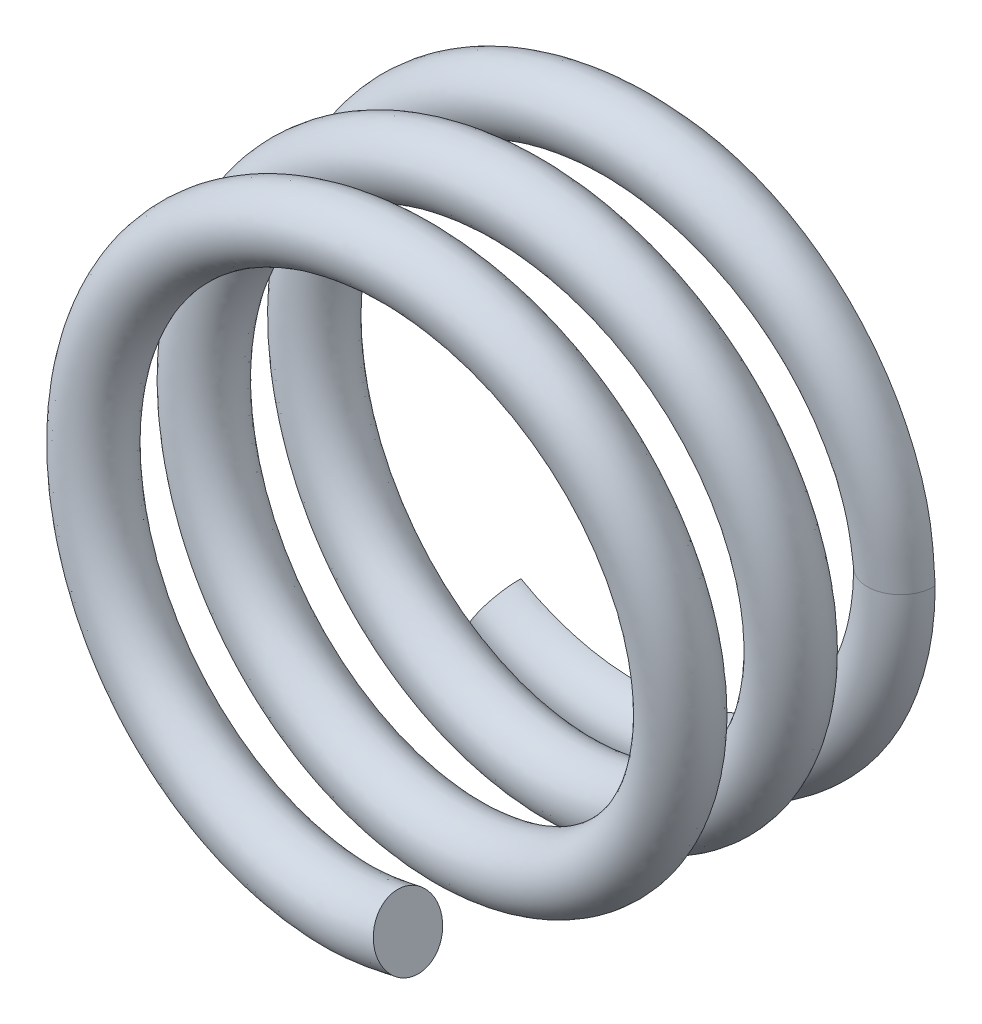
ISO-10303-21;
HEADER;
FILE_DESCRIPTION(('STEP AP214'),'2;1');
FILE_NAME('part.step','',(''),(''),'','','');
FILE_SCHEMA(('AUTOMOTIVE_DESIGN { 1 0 10303 214 1 1 1 1 }'));
ENDSEC;
DATA;
#1=APPLICATION_CONTEXT('core data for automotive mechanical design processes');
#2=APPLICATION_PROTOCOL_DEFINITION('international standard','automotive_design',2000,#1);
#3=PRODUCT_CONTEXT('',#1,'mechanical');
#4=PRODUCT('Part','Part','',(#3));
#5=PRODUCT_RELATED_PRODUCT_CATEGORY('part','',(#4));
#6=PRODUCT_DEFINITION_FORMATION('','',#4);
#7=PRODUCT_DEFINITION_CONTEXT('part definition',#1,'design');
#8=PRODUCT_DEFINITION('design','',#6,#7);
#9=PRODUCT_DEFINITION_SHAPE('','',#8);
#10=(LENGTH_UNIT() NAMED_UNIT(*) SI_UNIT(.MILLI.,.METRE.));
#11=(NAMED_UNIT(*) PLANE_ANGLE_UNIT() SI_UNIT($,.RADIAN.));
#12=(NAMED_UNIT(*) SI_UNIT($,.STERADIAN.) SOLID_ANGLE_UNIT());
#13=UNCERTAINTY_MEASURE_WITH_UNIT(LENGTH_MEASURE(1.E-05),#10,'distance_accuracy_value','');
#14=(GEOMETRIC_REPRESENTATION_CONTEXT(3) GLOBAL_UNCERTAINTY_ASSIGNED_CONTEXT((#13)) GLOBAL_UNIT_ASSIGNED_CONTEXT((#10,
#11,#12)) REPRESENTATION_CONTEXT('',''));
#15=CARTESIAN_POINT('',(0.,0.,0.));
#16=DIRECTION('',(0.,0.,1.));
#17=DIRECTION('',(1.,0.,0.));
#18=AXIS2_PLACEMENT_3D('',#15,#16,#17);
#19=CARTESIAN_POINT('',(12.,0.,1.5));
#20=CARTESIAN_POINT('',(11.9603713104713,0.731177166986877,1.54849427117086));
#21=CARTESIAN_POINT('',(11.8809443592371,2.19666022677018,1.64569032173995));
#22=CARTESIAN_POINT('',(11.2620280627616,4.32325216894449,1.79155371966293));
#23=CARTESIAN_POINT('',(10.2896280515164,6.30509649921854,1.93755795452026));
#24=CARTESIAN_POINT('',(8.96763299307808,8.07535029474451,2.08335110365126));
#25=CARTESIAN_POINT('',(7.34519233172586,9.57242636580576,2.22917046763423));
#26=CARTESIAN_POINT('',(5.47846168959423,10.7517410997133,2.37496569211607));
#27=CARTESIAN_POINT('',(3.42708930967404,11.5698049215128,2.52086018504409));
#28=CARTESIAN_POINT('',(1.26135363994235,12.0005154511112,2.66665382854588));
#29=CARTESIAN_POINT('',(-0.946832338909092,12.0300652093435,2.81251271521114));
#30=CARTESIAN_POINT('',(-3.12287162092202,11.654859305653,2.95832053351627));
#31=CARTESIAN_POINT('',(-5.19533038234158,10.8922151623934,3.10417314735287));
#32=CARTESIAN_POINT('',(-7.09200037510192,9.76130690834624,3.25000059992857));
#33=CARTESIAN_POINT('',(-8.75386804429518,8.30714801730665,3.39582788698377));
#34=CARTESIAN_POINT('',(-10.119061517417,6.57134770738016,3.54167658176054));
#35=CARTESIAN_POINT('',(-11.1493056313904,4.61825453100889,3.68748521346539));
#36=CARTESIAN_POINT('',(-11.8021776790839,2.50856434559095,3.8333513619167));
#37=CARTESIAN_POINT('',(-12.0633531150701,0.315962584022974,3.97914646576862));
#38=CARTESIAN_POINT('',(-11.9177644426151,-1.88765780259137,4.12502086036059));
#39=CARTESIAN_POINT('',(-11.3747674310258,-4.02794086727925,4.27081308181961));
#40=CARTESIAN_POINT('',(-10.4502596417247,-6.03352237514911,4.41668500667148));
#41=CARTESIAN_POINT('',(-9.17529768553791,-7.83637417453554,4.56248507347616));
#42=CARTESIAN_POINT('',(-7.59434030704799,-9.37827116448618,4.70834416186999));
#43=CARTESIAN_POINT('',(-5.75731397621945,-10.6036082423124,4.85416105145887));
#44=CARTESIAN_POINT('',(-3.72922558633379,-11.4773479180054,5.00000024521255));
#45=CARTESIAN_POINT('',(-1.57485201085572,-11.9623402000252,5.14583849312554));
#46=CARTESIAN_POINT('',(0.631550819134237,-12.0515300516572,5.29165624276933));
#47=CARTESIAN_POINT('',(2.81672677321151,-11.7322774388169,5.43751456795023));
#48=CARTESIAN_POINT('',(4.90833399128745,-11.0244622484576,5.58331520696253));
#49=CARTESIAN_POINT('',(6.83434805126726,-9.94391600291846,5.72918674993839));
#50=CARTESIAN_POINT('',(8.53274353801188,-8.53284811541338,5.87497907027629));
#51=CARTESIAN_POINT('',(9.94446517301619,-6.83456494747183,6.02085362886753));
#52=CARTESIAN_POINT('',(11.02333168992,-4.90797393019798,6.16664846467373));
#53=CARTESIAN_POINT('',(11.7338559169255,-2.81700710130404,6.31251511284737));
#54=CARTESIAN_POINT('',(12.0494652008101,-0.631524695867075,6.45832269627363));
#55=CARTESIAN_POINT('',(11.9645671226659,1.57517466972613,6.60417242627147));
#56=CARTESIAN_POINT('',(11.4751000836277,3.72848434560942,6.74999977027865));
#57=CARTESIAN_POINT('',(10.6056574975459,5.75837192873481,6.89582804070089));
#58=CARTESIAN_POINT('',(9.37668509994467,7.59314053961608,7.04167687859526));
#59=CARTESIAN_POINT('',(7.83754685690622,9.17650104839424,7.18748520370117));
#60=CARTESIAN_POINT('',(6.03286015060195,10.4493495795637,7.33335126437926));
#61=CARTESIAN_POINT('',(4.02827918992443,11.3752927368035,7.47914645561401));
#62=CARTESIAN_POINT('',(1.88752245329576,11.9177855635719,7.62502088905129));
#63=CARTESIAN_POINT('',(-0.31580290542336,12.0627488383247,7.77081308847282));
#64=CARTESIAN_POINT('',(-2.50891296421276,11.8032485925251,7.91668499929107));
#65=CARTESIAN_POINT('',(-4.61751183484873,11.1477994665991,8.06248507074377));
#66=CARTESIAN_POINT('',(-6.5724856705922,10.120691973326,8.20834416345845));
#67=CARTESIAN_POINT('',(-8.30552284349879,8.75222611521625,8.35416105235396));
#68=CARTESIAN_POINT('',(-9.76321245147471,7.09339985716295,8.50000024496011));
#69=CARTESIAN_POINT('',(-10.8902055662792,5.19433968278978,8.64583849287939));
#70=CARTESIAN_POINT('',(-11.6568461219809,3.12348707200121,8.79165624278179));
#71=CARTESIAN_POINT('',(-12.0284753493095,0.946606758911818,8.93751456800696));
#72=CARTESIAN_POINT('',(-12.0016452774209,-1.26135683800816,9.08331520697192));
#73=CARTESIAN_POINT('',(-11.5691558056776,-3.42701221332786,9.22918674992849));
#74=CARTESIAN_POINT('',(-10.7519835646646,-5.47832626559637,9.37497907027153));
#75=CARTESIAN_POINT('',(-9.57306626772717,-7.34575168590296,9.52085362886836));
#76=CARTESIAN_POINT('',(-8.0741574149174,-8.96716408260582,9.66664846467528));
#77=CARTESIAN_POINT('',(-6.30509384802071,-10.2890570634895,9.8125151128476));
#78=CARTESIAN_POINT('',(-4.32410519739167,-11.2645705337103,9.95832269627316));
#79=CARTESIAN_POINT('',(-2.19917443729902,-11.8657352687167,10.1041724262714));
#80=CARTESIAN_POINT('',(-1.60519495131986E-06,-12.065633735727,10.2499997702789));
#81=CARTESIAN_POINT('',(2.19920874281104,-11.8660144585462,10.3958280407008));
#82=CARTESIAN_POINT('',(4.32395074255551,-11.2641669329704,10.5416768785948));
#83=CARTESIAN_POINT('',(6.30543594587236,-10.2896447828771,10.6874852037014));
#84=CARTESIAN_POINT('',(8.07366569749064,-8.96661755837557,10.8333512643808));
#85=CARTESIAN_POINT('',(9.57373955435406,-7.34627994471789,10.9791464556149));
#86=CARTESIAN_POINT('',(10.7512111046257,-5.47793880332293,11.1250208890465));
#87=CARTESIAN_POINT('',(11.5699443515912,-3.427247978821,11.2708130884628));
#88=CARTESIAN_POINT('',(12.000853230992,-1.26128638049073,11.4166849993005));
#89=CARTESIAN_POINT('',(12.0290769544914,0.946655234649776,11.5624850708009));
#90=CARTESIAN_POINT('',(11.6563598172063,3.1233395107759,11.7083441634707));
#91=CARTESIAN_POINT('',(10.8904093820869,5.19443501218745,11.8541610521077));
#92=CARTESIAN_POINT('',(9.76322272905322,7.09338571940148,12.0000002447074));
#93=CARTESIAN_POINT('',(8.30536920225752,8.75206173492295,12.1458384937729));
#94=CARTESIAN_POINT('',(6.57277627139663,10.1211088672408,12.2916562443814));
#95=CARTESIAN_POINT('',(4.61727980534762,11.1472422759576,12.4375145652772));
#96=CARTESIAN_POINT('',(2.50909074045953,11.8040237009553,12.5833151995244));
#97=CARTESIAN_POINT('',(0.315783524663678,12.0619260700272,12.7291867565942));
#98=CARTESIAN_POINT('',(-1.88765223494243,11.9186397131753,12.8749790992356));
#99=CARTESIAN_POINT('',(-4.02798501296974,11.3744889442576,13.0208536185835));
#100=CARTESIAN_POINT('',(-6.03322846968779,10.4499868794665,13.1666483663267));
#101=CARTESIAN_POINT('',(-7.8370936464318,9.1759951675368,13.3125151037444));
#102=CARTESIAN_POINT('',(-9.37701853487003,7.5934104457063,13.458322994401));
#103=CARTESIAN_POINT('',(-10.6053987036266,5.75824916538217,13.6041725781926));
#104=CARTESIAN_POINT('',(-11.4751097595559,3.72848984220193,13.7499989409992));
#105=CARTESIAN_POINT('',(-11.9648654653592,1.57523319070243,13.8958273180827));
#106=CARTESIAN_POINT('',(-12.048998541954,-0.631500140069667,14.041679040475));
#107=CARTESIAN_POINT('',(-11.7344478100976,-2.81713283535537,14.1874876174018));
#108=CARTESIAN_POINT('',(-11.0227502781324,-4.90769840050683,14.3333458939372));
#109=CARTESIAN_POINT('',(-9.94535705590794,-6.83518686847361,14.4791398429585));
#110=CARTESIAN_POINT('',(-8.53194028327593,-8.53214432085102,14.6250343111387));
#111=CARTESIAN_POINT('',(-6.83442993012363,-9.94417796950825,14.7708294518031));
#112=CARTESIAN_POINT('',(-4.90864738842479,-11.0234482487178,14.9166489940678));
#113=CARTESIAN_POINT('',(-2.81706134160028,-11.7353683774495,15.0624416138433));
#114=CARTESIAN_POINT('',(-0.631513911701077,-12.046249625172,15.2084468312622));
#115=CARTESIAN_POINT('',(1.58226116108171,-11.9782283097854,15.3543091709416));
#116=CARTESIAN_POINT('',(3.00051631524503,-11.600770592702,15.4515056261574));
#117=CARTESIAN_POINT('',(3.70812820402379,-11.4124451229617,15.4999999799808));
#118=CARTESIAN_POINT('',(15.,0.,1.5));
#119=CARTESIAN_POINT('',(14.9503984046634,0.915065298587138,1.54856790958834));
#120=CARTESIAN_POINT('',(14.8509829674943,2.74911148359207,1.64591155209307));
#121=CARTESIAN_POINT('',(14.0797344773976,5.39818093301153,1.79125837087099));
#122=CARTESIAN_POINT('',(12.8607492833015,7.88413226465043,1.93881104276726));
#123=CARTESIAN_POINT('',(11.2110255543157,10.0923728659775,2.08281692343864));
#124=CARTESIAN_POINT('',(9.17823055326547,11.9683646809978,2.22996355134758));
#125=CARTESIAN_POINT('',(6.85263971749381,13.4374504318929,2.37428555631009));
#126=CARTESIAN_POINT('',(4.27985179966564,14.4637051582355,2.52213780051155));
#127=CARTESIAN_POINT('',(1.58026878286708,15.0003668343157,2.66618767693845));
#128=CARTESIAN_POINT('',(-1.18706321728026,15.0374503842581,2.81337027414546));
#129=CARTESIAN_POINT('',(-3.90143343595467,14.5693225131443,2.95810576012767));
#130=CARTESIAN_POINT('',(-6.49546636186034,13.6147491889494,3.10473477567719));
#131=CARTESIAN_POINT('',(-8.8651140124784,12.2018001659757,3.25025394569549));
#132=CARTESIAN_POINT('',(-10.9413524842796,10.3849920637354,3.39577947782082));
#133=CARTESIAN_POINT('',(-12.6502472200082,8.21249416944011,3.54235768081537));
#134=CARTESIAN_POINT('',(-13.9352839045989,5.77604070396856,3.68704217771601));
#135=CARTESIAN_POINT('',(-14.7537885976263,3.13210446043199,3.83434581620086));
#136=CARTESIAN_POINT('',(-15.0790925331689,0.399344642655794,3.97852178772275));
#137=CARTESIAN_POINT('',(-14.8967742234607,-2.36396364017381,4.12614386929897));
#138=CARTESIAN_POINT('',(-14.2199435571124,-5.03096821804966,4.27022116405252));
#139=CARTESIAN_POINT('',(-13.0609662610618,-7.54551020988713,4.41773758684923));
#140=CARTESIAN_POINT('',(-11.4712442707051,-9.79319756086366,4.56211613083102));
#141=CARTESIAN_POINT('',(-9.49099316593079,-11.7245607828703,4.70910406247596));
#142=CARTESIAN_POINT('',(-7.19775492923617,-13.2541115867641,4.85417719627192));
#143=CARTESIAN_POINT('',(-4.66155947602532,-14.3467267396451,5.00024532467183));
#144=CARTESIAN_POINT('',(-1.96747160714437,-14.9533078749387,5.14631247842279));
#145=CARTESIAN_POINT('',(0.786829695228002,-15.064544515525,5.29138642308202));
#146=CARTESIAN_POINT('',(3.5239615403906,-14.6649121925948,5.43837365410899));
#147=CARTESIAN_POINT('',(6.13168689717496,-13.7822340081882,5.58275293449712));
#148=CARTESIAN_POINT('',(8.54655182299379,-12.4277533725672,5.73026881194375));
#149=CARTESIAN_POINT('',(10.6628244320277,-10.6692289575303,5.87434564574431));
#150=CARTESIAN_POINT('',(12.4332419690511,-8.53974111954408,6.02196817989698));
#151=CARTESIAN_POINT('',(13.7777293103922,-6.13846325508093,6.16614569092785));
#152=CARTESIAN_POINT('',(14.668281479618,-3.51792692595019,6.31345000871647));
#153=CARTESIAN_POINT('',(15.0618775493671,-0.791639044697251,6.45812812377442));
#154=CARTESIAN_POINT('',(14.9556091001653,1.97039074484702,6.6047017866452));
#155=CARTESIAN_POINT('',(14.3440717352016,4.66065168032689,6.75024483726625));
#156=CARTESIAN_POINT('',(13.2577782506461,7.19669863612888,6.89578881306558));
#157=CARTESIAN_POINT('',(11.7196865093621,9.49330067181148,7.04236158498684));
#158=CARTESIAN_POINT('',(9.79958063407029,11.4683488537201,7.18704044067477));
#159=CARTESIAN_POINT('',(7.53798021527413,13.0638137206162,7.33434417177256));
#160=CARTESIAN_POINT('',(5.03949497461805,14.217664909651,7.47852203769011));
#161=CARTESIAN_POINT('',(2.35509325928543,14.8981788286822,7.62614444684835));
#162=CARTESIAN_POINT('',(-0.390530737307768,15.0786246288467,7.77022116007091));
#163=CARTESIAN_POINT('',(-3.14014609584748,14.7534080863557,7.91773740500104));
#164=CARTESIAN_POINT('',(-5.76907499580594,13.9360660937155,8.06211611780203));
#165=CARTESIAN_POINT('',(-8.21784175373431,12.6495593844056,8.20910411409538));
#166=CARTESIAN_POINT('',(-10.3811805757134,10.9412174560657,8.35417720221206));
#167=CARTESIAN_POINT('',(-12.2040468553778,8.86678890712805,8.50024531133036));
#168=CARTESIAN_POINT('',(-13.6134587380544,6.49200294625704,8.64631247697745));
#169=CARTESIAN_POINT('',(-14.5703769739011,3.90688075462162,8.79138642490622));
#170=CARTESIAN_POINT('',(-15.0361243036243,1.18022050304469,8.93837365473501));
#171=CARTESIAN_POINT('',(-15.0024789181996,-1.5726362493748,9.08275293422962));
#172=CARTESIAN_POINT('',(-14.4605255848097,-4.28786680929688,9.23026881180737));
#173=CARTESIAN_POINT('',(-13.442033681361,-6.84397559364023,9.37434564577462));
#174=CARTESIAN_POINT('',(-11.9638595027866,-9.18579065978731,9.52196817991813));
#175=CARTESIAN_POINT('',(-10.0955779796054,-11.2065097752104,9.66614569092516));
#176=CARTESIAN_POINT('',(-7.87849558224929,-12.8632654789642,9.81345000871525));
#177=CARTESIAN_POINT('',(-5.40726960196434,-14.0800668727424,9.95812812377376));
#178=CARTESIAN_POINT('',(-2.74758441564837,-14.8325137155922,10.1047017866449));
#179=CARTESIAN_POINT('',(-1.87839495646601E-05,-15.0822434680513,10.2502448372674));
#180=CARTESIAN_POINT('',(2.74758834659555,-14.8327985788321,10.3957888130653));
#181=CARTESIAN_POINT('',(5.40708316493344,-14.0796754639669,10.5423615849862));
#182=CARTESIAN_POINT('',(7.87881095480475,-12.8638697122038,10.6870404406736));
#183=CARTESIAN_POINT('',(10.0950611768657,-11.2059856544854,10.8343441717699));
#184=CARTESIAN_POINT('',(11.9645132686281,-9.18634461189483,10.9785220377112));
#185=CARTESIAN_POINT('',(13.441246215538,-6.84361723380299,11.1261444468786));
#186=CARTESIAN_POINT('',(14.461304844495,-4.28813445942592,11.2702211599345));
#187=CARTESIAN_POINT('',(15.0016834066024,-1.57259741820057,11.4177374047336));
#188=CARTESIAN_POINT('',(15.0367286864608,1.18023510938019,11.5621161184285));
#189=CARTESIAN_POINT('',(14.5698986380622,3.90670313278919,11.7091041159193));
#190=CARTESIAN_POINT('',(13.6136773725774,6.49206730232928,11.8541772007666));
#191=CARTESIAN_POINT('',(12.204075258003,8.86674982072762,12.0002452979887));
#192=CARTESIAN_POINT('',(10.3810518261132,10.9410293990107,12.1463124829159));
#193=CARTESIAN_POINT('',(8.2181584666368,12.6499594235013,12.2913864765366));
#194=CARTESIAN_POINT('',(5.7688742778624,13.9354958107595,12.4383736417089));
#195=CARTESIAN_POINT('',(3.14035505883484,14.7541767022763,12.5827527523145));
#196=CARTESIAN_POINT('',(0.390544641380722,15.0778008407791,12.7302688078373));
#197=CARTESIAN_POINT('',(-2.35519079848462,14.8990382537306,12.8743462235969));
#198=CARTESIAN_POINT('',(-5.03917032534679,14.2168717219,13.0219684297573));
#199=CARTESIAN_POINT('',(-7.53831923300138,13.0644681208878,13.1661440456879));
#200=CARTESIAN_POINT('',(-9.79910440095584,11.4678626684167,13.3134482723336));
#201=CARTESIAN_POINT('',(-11.7199994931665,9.49359560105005,13.4581320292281));
#202=CARTESIAN_POINT('',(-13.2575009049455,7.19660851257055,13.6047111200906));
#203=CARTESIAN_POINT('',(-14.3440684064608,4.66069990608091,13.7502357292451));
#204=CARTESIAN_POINT('',(-14.9559093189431,1.97045734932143,13.8957558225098));
#205=CARTESIAN_POINT('',(-15.0614083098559,-0.791628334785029,14.0423839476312));
#206=CARTESIAN_POINT('',(-14.6688839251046,-3.51796234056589,14.187120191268));
#207=CARTESIAN_POINT('',(-13.777241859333,-6.13797895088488,14.3343021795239));
#208=CARTESIAN_POINT('',(-12.4341201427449,-8.54044994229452,14.4783523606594));
#209=CARTESIAN_POINT('',(-10.6615801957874,-10.6689719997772,14.6262045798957));
#210=CARTESIAN_POINT('',(-8.54668992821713,-12.4278679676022,14.7705265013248));
#211=CARTESIAN_POINT('',(-6.13373283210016,-13.7803223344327,14.9176733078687));
#212=CARTESIAN_POINT('',(-3.52432662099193,-14.6685911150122,15.0616786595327));
#213=CARTESIAN_POINT('',(-0.783143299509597,-15.0582172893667,15.2092323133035));
#214=CARTESIAN_POINT('',(1.97460691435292,-14.9736241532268,15.3545780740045));
#215=CARTESIAN_POINT('',(3.74956574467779,-14.5012879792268,15.4519221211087));
#216=CARTESIAN_POINT('',(4.63514826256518,-14.2656246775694,15.5004901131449));
#217=CARTESIAN_POINT('',(15.,0.,-1.5));
#218=CARTESIAN_POINT('',(14.9504707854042,0.915076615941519,-1.45143208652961));
#219=CARTESIAN_POINT('',(14.8512004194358,2.74914548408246,-1.35408843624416));
#220=CARTESIAN_POINT('',(14.0794493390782,5.39812567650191,-1.208741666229));
#221=CARTESIAN_POINT('',(12.8618126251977,7.88477268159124,-1.06118881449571));
#222=CARTESIAN_POINT('',(11.2106417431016,10.0920226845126,-0.917183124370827));
#223=CARTESIAN_POINT('',(9.17870901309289,11.968982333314,-0.770036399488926));
#224=CARTESIAN_POINT('',(6.8523267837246,13.436864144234,-0.625714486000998));
#225=CARTESIAN_POINT('',(4.28019566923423,14.4649222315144,-0.47786206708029));
#226=CARTESIAN_POINT('',(1.58022660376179,14.9999169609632,-0.333812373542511));
#227=CARTESIAN_POINT('',(-1.18714699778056,15.0382952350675,-0.186629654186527));
#228=CARTESIAN_POINT('',(-3.90137248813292,14.569125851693,-0.0418942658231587));
#229=CARTESIAN_POINT('',(-6.49573117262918,13.6152427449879,0.104734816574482));
#230=CARTESIAN_POINT('',(-8.86526154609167,12.2020077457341,0.250253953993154));
#231=CARTESIAN_POINT('',(-10.9413369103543,10.3849453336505,0.395779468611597));
#232=CARTESIAN_POINT('',(-12.6508095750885,8.21286733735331,0.542357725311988));
#233=CARTESIAN_POINT('',(-13.9348930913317,5.77585663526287,0.687042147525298));
#234=CARTESIAN_POINT('',(-14.7547492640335,3.13231244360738,0.83434589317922));
#235=CARTESIAN_POINT('',(-15.0784837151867,0.39931820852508,0.978521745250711));
#236=CARTESIAN_POINT('',(-14.8978694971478,-2.36414274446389,1.12614396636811));
#237=CARTESIAN_POINT('',(-14.2194003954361,-5.0307755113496,1.27022111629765));
#238=CARTESIAN_POINT('',(-13.0618599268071,-7.54604528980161,1.41773768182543));
#239=CARTESIAN_POINT('',(-11.4709771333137,-9.79296075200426,1.5621160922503));
#240=CARTESIAN_POINT('',(-9.49144976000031,-11.7251615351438,1.7091041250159));
#241=CARTESIAN_POINT('',(-7.1977695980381,-13.2541280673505,1.85417718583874));
#242=CARTESIAN_POINT('',(-4.66161192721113,-14.3469688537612,2.00024533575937));
#243=CARTESIAN_POINT('',(-1.96753792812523,-14.9537745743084,2.14631250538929));
#244=CARTESIAN_POINT('',(0.786838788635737,-15.0642823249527,2.29138640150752));
#245=CARTESIAN_POINT('',(3.52415401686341,-14.6657399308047,2.43837371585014));
#246=CARTESIAN_POINT('',(6.13147835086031,-13.7817265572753,2.5827528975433));
#247=CARTESIAN_POINT('',(8.5471577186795,-12.4286343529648,2.73026890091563));
#248=CARTESIAN_POINT('',(10.6623912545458,-10.6687889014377,2.87434559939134));
#249=CARTESIAN_POINT('',(12.4341564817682,-8.54035598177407,3.02196827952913));
#250=CARTESIAN_POINT('',(13.7772812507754,-6.13826856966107,3.16614564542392));
#251=CARTESIAN_POINT('',(14.6691868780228,-3.51812292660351,3.31345009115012));
#252=CARTESIAN_POINT('',(15.0616918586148,-0.79163612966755,3.4581280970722));
#253=CARTESIAN_POINT('',(14.9561285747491,1.97048377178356,3.60470182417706));
#254=CARTESIAN_POINT('',(14.3443071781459,4.66072450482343,3.75024484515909));
#255=CARTESIAN_POINT('',(13.2577366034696,7.19670354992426,3.89578880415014));
#256=CARTESIAN_POINT('',(11.7202178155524,9.49372262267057,4.04236163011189));
#257=CARTESIAN_POINT('',(9.79928390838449,11.4680325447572,4.18704041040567));
#258=CARTESIAN_POINT('',(7.53847417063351,13.0646617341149,4.33434424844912));
#259=CARTESIAN_POINT('',(5.03928173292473,14.2170943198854,4.47852199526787));
#260=CARTESIAN_POINT('',(2.3552614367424,14.8992763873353,4.62614454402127));
#261=CARTESIAN_POINT('',(-0.39051530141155,15.0780484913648,4.7702211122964));
#262=CARTESIAN_POINT('',(-3.14037878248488,14.7544231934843,4.91773749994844));
#263=CARTESIAN_POINT('',(-5.76893232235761,13.9357388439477,5.06211607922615));
#264=CARTESIAN_POINT('',(-8.21827203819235,12.6501793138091,5.20910417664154));
#265=CARTESIAN_POINT('',(-10.381191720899,10.9412365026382,5.35417719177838));
#266=CARTESIAN_POINT('',(-12.2042608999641,8.86691360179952,5.50024532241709));
#267=CARTESIAN_POINT('',(-13.6138821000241,6.49221023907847,5.64631250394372));
#268=CARTESIAN_POINT('',(-14.5701304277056,3.90679108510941,5.79138640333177));
#269=CARTESIAN_POINT('',(-15.0369710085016,1.18029323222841,5.93837371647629));
#270=CARTESIAN_POINT('',(-15.0019318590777,-1.57259472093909,6.08275289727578));
#271=CARTESIAN_POINT('',(-14.4615506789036,-4.28817081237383,6.23026890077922));
#272=CARTESIAN_POINT('',(-13.4414813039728,-6.84369960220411,6.37434559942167));
#273=CARTESIAN_POINT('',(-11.9647268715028,-9.18647041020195,6.52196827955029));
#274=CARTESIAN_POINT('',(-10.0952543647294,-11.2061438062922,6.66614564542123));
#275=CARTESIAN_POINT('',(-7.87896177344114,-12.8640659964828,6.8134500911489));
#276=CARTESIAN_POINT('',(-5.40720944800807,-14.079891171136,6.95812809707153));
#277=CARTESIAN_POINT('',(-2.74765646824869,-14.8330365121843,7.10470182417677));
#278=CARTESIAN_POINT('',(-2.22796085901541E-05,-15.0824898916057,7.25024484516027));
#279=CARTESIAN_POINT('',(2.74760588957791,-14.8327604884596,7.39578880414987));
#280=CARTESIAN_POINT('',(5.40732028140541,-14.0803111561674,7.54236163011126));
#281=CARTESIAN_POINT('',(7.87860182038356,-12.8634897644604,7.68704041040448));
#282=CARTESIAN_POINT('',(10.0957150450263,-11.2067174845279,7.83434424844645));
#283=CARTESIAN_POINT('',(11.9640365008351,-9.18596548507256,7.97852199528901));
#284=CARTESIAN_POINT('',(13.4422380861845,-6.8441163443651,8.12614454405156));
#285=CARTESIAN_POINT('',(14.4607521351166,-4.28797110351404,8.27022111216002));
#286=CARTESIAN_POINT('',(15.002720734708,-1.57268980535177,8.41773749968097));
#287=CARTESIAN_POINT('',(15.0363733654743,1.18020054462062,8.56211607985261));
#288=CARTESIAN_POINT('',(14.5706211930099,3.90692078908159,8.70910417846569));
#289=CARTESIAN_POINT('',(13.6136989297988,6.49207201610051,8.85417719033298));
#290=CARTESIAN_POINT('',(12.2042599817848,8.86691484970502,9.00024530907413));
#291=CARTESIAN_POINT('',(10.3813798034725,10.9413679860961,9.14631250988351));
#292=CARTESIAN_POINT('',(8.21799702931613,12.6497526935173,9.29138645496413));
#293=CARTESIAN_POINT('',(5.76920508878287,13.9362785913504,9.43837370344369));
#294=CARTESIAN_POINT('',(3.14022545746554,14.7536434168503,9.58275271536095));
#295=CARTESIAN_POINT('',(0.390572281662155,15.0788696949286,9.73026889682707));
#296=CARTESIAN_POINT('',(-2.35509906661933,14.8984281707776,9.87434617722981));
#297=CARTESIAN_POINT('',(-5.03954880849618,14.2179069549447,10.0219685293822));
#298=CARTESIAN_POINT('',(-7.53807046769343,13.0640458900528,10.166144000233));
#299=CARTESIAN_POINT('',(-9.79972077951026,11.4685519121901,10.3134483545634));
#300=CARTESIAN_POINT('',(-11.7198536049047,9.49348653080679,10.4581320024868));
#301=CARTESIAN_POINT('',(-13.2579834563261,7.19684387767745,10.6047111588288));
#302=CARTESIAN_POINT('',(-14.3442941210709,4.66077603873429,10.7502357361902));
#303=CARTESIAN_POINT('',(-14.9558467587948,1.97042258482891,10.895755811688));
#304=CARTESIAN_POINT('',(-15.0621063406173,-0.791657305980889,11.0423839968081));
#305=CARTESIAN_POINT('',(-14.6685339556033,-3.51789544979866,11.1871201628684));
#306=CARTESIAN_POINT('',(-13.7781067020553,-6.13835908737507,11.3343022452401));
#307=CARTESIAN_POINT('',(-12.4334755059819,-8.54002541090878,11.478352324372));
#308=CARTESIAN_POINT('',(-10.662389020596,-10.6697999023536,11.626204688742));
#309=CARTESIAN_POINT('',(-8.5465301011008,-12.4276278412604,11.7705264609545));
#310=CARTESIAN_POINT('',(-6.1341474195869,-13.78124598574,11.9176733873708));
#311=CARTESIAN_POINT('',(-3.5241616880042,-14.6678611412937,12.0616786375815));
#312=CARTESIAN_POINT('',(-0.783132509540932,-15.0589976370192,12.2092323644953));
#313=CARTESIAN_POINT('',(1.97463615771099,-14.9738962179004,12.3545780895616));
#314=CARTESIAN_POINT('',(3.74967652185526,-14.5016895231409,12.4519221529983));
#315=CARTESIAN_POINT('',(4.63529971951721,-14.2660908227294,12.5004901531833));
#316=CARTESIAN_POINT('',(12.,0.,-1.5));
#317=CARTESIAN_POINT('',(11.9604436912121,0.731188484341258,-1.45150572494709));
#318=CARTESIAN_POINT('',(11.8811618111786,2.19669422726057,-1.35430966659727));
#319=CARTESIAN_POINT('',(11.2617429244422,4.32319691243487,-1.20844631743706));
#320=CARTESIAN_POINT('',(10.2906913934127,6.30573691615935,-1.06244190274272));
#321=CARTESIAN_POINT('',(8.96724918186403,8.07500011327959,-0.916648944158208));
#322=CARTESIAN_POINT('',(7.34567079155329,9.573044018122,-0.770829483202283));
#323=CARTESIAN_POINT('',(5.47814875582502,10.7511548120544,-0.625034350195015));
#324=CARTESIAN_POINT('',(3.42743317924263,11.5710219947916,-0.479139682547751));
#325=CARTESIAN_POINT('',(1.26131146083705,12.0000655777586,-0.333346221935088));
#326=CARTESIAN_POINT('',(-0.946916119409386,12.0309100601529,-0.187487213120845));
#327=CARTESIAN_POINT('',(-3.12281067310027,11.6546626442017,-0.0416794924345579));
#328=CARTESIAN_POINT('',(-5.19559519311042,10.8927087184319,0.104173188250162));
#329=CARTESIAN_POINT('',(-7.09214790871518,9.7615144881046,0.250000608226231));
#330=CARTESIAN_POINT('',(-8.75385247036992,8.30710128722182,0.395827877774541));
#331=CARTESIAN_POINT('',(-10.1196238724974,6.57172087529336,0.541676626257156));
#332=CARTESIAN_POINT('',(-11.1489148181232,4.6180704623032,0.687485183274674));
#333=CARTESIAN_POINT('',(-11.803138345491,2.50877232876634,0.833351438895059));
#334=CARTESIAN_POINT('',(-12.0627442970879,0.315936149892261,0.979146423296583));
#335=CARTESIAN_POINT('',(-11.9188597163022,-1.88783690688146,1.12502095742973));
#336=CARTESIAN_POINT('',(-11.3742242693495,-4.02774816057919,1.27081303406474));
#337=CARTESIAN_POINT('',(-10.4511533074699,-6.03405745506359,1.41668510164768));
#338=CARTESIAN_POINT('',(-9.17503054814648,-7.83613736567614,1.56248503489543));
#339=CARTESIAN_POINT('',(-7.59479690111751,-9.37887191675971,1.70834422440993));
#340=CARTESIAN_POINT('',(-5.75732864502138,-10.6036247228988,1.85416104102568));
#341=CARTESIAN_POINT('',(-3.7292780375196,-11.4775900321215,2.0000002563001));
#342=CARTESIAN_POINT('',(-1.57491833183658,-11.9628068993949,2.14583852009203));
#343=CARTESIAN_POINT('',(0.631559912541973,-12.051267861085,2.29165622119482));
#344=CARTESIAN_POINT('',(2.81691924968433,-11.7331051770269,2.43751462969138));
#345=CARTESIAN_POINT('',(4.9081254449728,-11.0239547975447,2.5833151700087));
#346=CARTESIAN_POINT('',(6.83495394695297,-9.9447969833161,2.72918683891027));
#347=CARTESIAN_POINT('',(8.53231036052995,-8.53240805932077,2.87497902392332));
#348=CARTESIAN_POINT('',(9.94537968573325,-6.83517980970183,3.02085372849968));
#349=CARTESIAN_POINT('',(11.0228836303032,-4.90777924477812,3.16664841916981));
#350=CARTESIAN_POINT('',(11.7347613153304,-2.81720310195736,3.31251519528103));
#351=CARTESIAN_POINT('',(12.0492795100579,-0.631521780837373,3.45832266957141));
#352=CARTESIAN_POINT('',(11.9650865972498,1.57526769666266,3.60417246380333));
#353=CARTESIAN_POINT('',(11.475335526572,3.72855717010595,3.74999977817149));
#354=CARTESIAN_POINT('',(10.6056158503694,5.75837684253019,3.89582803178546));
#355=CARTESIAN_POINT('',(9.37721640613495,7.59356249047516,4.04167692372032));
#356=CARTESIAN_POINT('',(7.83725013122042,9.17618473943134,4.18748517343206));
#357=CARTESIAN_POINT('',(6.03335410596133,10.4501975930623,4.33335134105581));
#358=CARTESIAN_POINT('',(4.02806594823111,11.374722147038,4.47914641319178));
#359=CARTESIAN_POINT('',(1.88769063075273,11.918883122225,4.62502098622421));
#360=CARTESIAN_POINT('',(-0.315787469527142,12.0621727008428,4.77081304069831));
#361=CARTESIAN_POINT('',(-2.50914565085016,11.8042636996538,4.91668509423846));
#362=CARTESIAN_POINT('',(-4.61736916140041,11.1474722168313,5.0624850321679));
#363=CARTESIAN_POINT('',(-6.57291595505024,10.1213119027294,5.20834422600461));
#364=CARTESIAN_POINT('',(-8.30553398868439,8.75224516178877,5.35416104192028));
#365=CARTESIAN_POINT('',(-9.76342649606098,7.09352455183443,5.50000025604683));
#366=CARTESIAN_POINT('',(-10.8906289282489,5.19454697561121,5.64583851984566));
#367=CARTESIAN_POINT('',(-11.6565995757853,3.123397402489,5.79165622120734));
#368=CARTESIAN_POINT('',(-12.0293220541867,0.946679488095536,5.93751462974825));
#369=CARTESIAN_POINT('',(-12.001098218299,-1.26131530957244,6.08331517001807));
#370=CARTESIAN_POINT('',(-11.5701808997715,-3.42731621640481,6.22918683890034));
#371=CARTESIAN_POINT('',(-10.7514311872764,-5.47805027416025,6.37497902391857));
#372=CARTESIAN_POINT('',(-9.57393363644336,-7.3464314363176,6.52085372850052));
#373=CARTESIAN_POINT('',(-8.07383380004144,-8.9667981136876,6.66664841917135));
#374=CARTESIAN_POINT('',(-6.30556003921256,-10.2898575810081,6.81251519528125));
#375=CARTESIAN_POINT('',(-4.32404504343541,-11.2643948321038,6.95832266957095));
#376=CARTESIAN_POINT('',(-2.19924648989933,-11.8662580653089,7.10417246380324));
#377=CARTESIAN_POINT('',(-5.10085397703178E-06,-12.0658801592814,7.24999977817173));
#378=CARTESIAN_POINT('',(2.1992262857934,-11.8659763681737,7.39582803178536));
#379=CARTESIAN_POINT('',(4.32418785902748,-11.264802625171,7.54167692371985));
#380=CARTESIAN_POINT('',(6.30522681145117,-10.2892648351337,7.68748517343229));
#381=CARTESIAN_POINT('',(8.07431956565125,-8.96734938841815,7.83335134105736));
#382=CARTESIAN_POINT('',(9.57326278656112,-7.34590081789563,7.97914641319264));
#383=CARTESIAN_POINT('',(10.7522029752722,-5.47843791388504,8.12502098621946));
#384=CARTESIAN_POINT('',(11.5693916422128,-3.42708462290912,8.27081304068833));
#385=CARTESIAN_POINT('',(12.0018905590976,-1.26137876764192,8.41668509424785));
#386=CARTESIAN_POINT('',(12.0287216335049,0.94662066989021,8.56248503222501));
#387=CARTESIAN_POINT('',(11.657082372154,3.12355716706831,8.70834422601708));
#388=CARTESIAN_POINT('',(10.8904309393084,5.19443972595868,8.85416104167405));
#389=CARTESIAN_POINT('',(9.76340745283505,7.09355074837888,9.00000025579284));
#390=CARTESIAN_POINT('',(8.30569717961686,8.75240032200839,9.14583852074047));
#391=CARTESIAN_POINT('',(6.57261483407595,10.1209021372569,9.29165622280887));
#392=CARTESIAN_POINT('',(4.6176106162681,11.1480250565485,9.43751462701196));
#393=CARTESIAN_POINT('',(2.50896113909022,11.8034904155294,9.58331516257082));
#394=CARTESIAN_POINT('',(0.315811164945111,12.0629949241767,9.72918684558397));
#395=CARTESIAN_POINT('',(-1.88756050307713,11.9180296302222,9.87497905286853));
#396=CARTESIAN_POINT('',(-4.02836349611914,11.3755241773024,10.0208537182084));
#397=CARTESIAN_POINT('',(-6.03297970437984,10.4495646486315,10.1666483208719));
#398=CARTESIAN_POINT('',(-7.83771002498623,9.17668441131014,10.3125151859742));
#399=CARTESIAN_POINT('',(-9.3768726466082,7.59330137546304,10.4583229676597));
#400=CARTESIAN_POINT('',(-10.6058812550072,5.75848453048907,10.6041726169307));
#401=CARTESIAN_POINT('',(-11.475335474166,3.72856597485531,10.7499989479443));
#402=CARTESIAN_POINT('',(-11.9648029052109,1.57519842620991,10.8958273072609));
#403=CARTESIAN_POINT('',(-12.0496965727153,-0.631529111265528,11.0416790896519));
#404=CARTESIAN_POINT('',(-11.7340978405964,-2.81706594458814,11.1874875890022));
#405=CARTESIAN_POINT('',(-11.0236151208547,-4.90807853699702,11.3333459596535));
#406=CARTESIAN_POINT('',(-9.94471241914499,-6.83476233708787,11.4791398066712));
#407=CARTESIAN_POINT('',(-8.53274910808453,-8.53297222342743,11.625034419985));
#408=CARTESIAN_POINT('',(-6.8342701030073,-9.94393784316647,11.7708294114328));
#409=CARTESIAN_POINT('',(-4.90906197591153,-11.0243719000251,11.9166490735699));
#410=CARTESIAN_POINT('',(-2.81689640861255,-11.734638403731,12.0624415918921));
#411=CARTESIAN_POINT('',(-0.631503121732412,-12.0470299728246,12.208446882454));
#412=CARTESIAN_POINT('',(1.58229040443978,-11.9785003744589,12.3543091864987));
#413=CARTESIAN_POINT('',(3.0006270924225,-11.6011721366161,12.451505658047));
#414=CARTESIAN_POINT('',(3.70827966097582,-11.4129112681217,12.5000000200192));
#415=CARTESIAN_POINT('',(9.,0.,-1.5));
#416=CARTESIAN_POINT('',(8.97041659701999,0.547300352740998,-1.45157936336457));
#417=CARTESIAN_POINT('',(8.91112320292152,1.64424297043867,-1.35453089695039));
#418=CARTESIAN_POINT('',(8.44403650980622,3.24826814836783,-1.20815096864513));
#419=CARTESIAN_POINT('',(7.71957016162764,4.72670115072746,-1.06369499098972));
#420=CARTESIAN_POINT('',(6.72385662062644,6.05797754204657,-0.91611476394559));
#421=CARTESIAN_POINT('',(5.51263257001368,7.17710570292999,-0.771622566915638));
#422=CARTESIAN_POINT('',(4.10397072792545,8.06544547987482,-0.624354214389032));
#423=CARTESIAN_POINT('',(2.57467068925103,8.67712175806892,-0.48041729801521));
#424=CARTESIAN_POINT('',(0.942396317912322,9.00021419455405,-0.332880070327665));
#425=CARTESIAN_POINT('',(-0.706685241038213,9.02352488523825,-0.188344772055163));
#426=CARTESIAN_POINT('',(-2.34424885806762,8.74019943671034,-0.0414647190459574));
#427=CARTESIAN_POINT('',(-3.89545921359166,8.17017469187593,0.103611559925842));
#428=CARTESIAN_POINT('',(-5.3190342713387,7.32102123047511,0.24974726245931));
#429=CARTESIAN_POINT('',(-6.56636803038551,6.22925724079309,0.395876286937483));
#430=CARTESIAN_POINT('',(-7.58843816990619,4.93057441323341,0.540995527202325));
#431=CARTESIAN_POINT('',(-8.36293654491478,3.46028428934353,0.68792821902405));
#432=CARTESIAN_POINT('',(-8.85152742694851,1.8852322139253,0.8323569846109));
#433=CARTESIAN_POINT('',(-9.04700487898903,0.232554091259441,0.979771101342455));
#434=CARTESIAN_POINT('',(-8.93984993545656,-1.41153106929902,1.12389794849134));
#435=CARTESIAN_POINT('',(-8.52904814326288,-3.02472080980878,1.27140495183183));
#436=CARTESIAN_POINT('',(-7.8404466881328,-4.52206962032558,1.41563252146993));
#437=CARTESIAN_POINT('',(-6.87908396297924,-5.87931397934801,1.56285397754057));
#438=CARTESIAN_POINT('',(-5.69814404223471,-7.0325822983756,1.70758432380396));
#439=CARTESIAN_POINT('',(-4.31688769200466,-7.95312137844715,1.85414489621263));
#440=CARTESIAN_POINT('',(-2.79694414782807,-8.6082112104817,1.99975517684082));
#441=CARTESIAN_POINT('',(-1.18229873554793,-8.97183922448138,2.14536453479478));
#442=CARTESIAN_POINT('',(0.476281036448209,-9.03825339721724,2.29192604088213));
#443=CARTESIAN_POINT('',(2.10968448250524,-8.80047042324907,2.43665554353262));
#444=CARTESIAN_POINT('',(3.68477253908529,-8.26618303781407,2.58387744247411));
#445=CARTESIAN_POINT('',(5.12275017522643,-7.4609596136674,2.72810477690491));
#446=CARTESIAN_POINT('',(6.4022294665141,-6.39602721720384,2.8756124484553));
#447=CARTESIAN_POINT('',(7.45660288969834,-5.13000363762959,3.01973917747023));
#448=CARTESIAN_POINT('',(8.26848600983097,-3.67728991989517,3.16715119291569));
#449=CARTESIAN_POINT('',(8.80033575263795,-2.11628327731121,3.31158029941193));
#450=CARTESIAN_POINT('',(9.03686716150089,-0.471407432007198,3.45851724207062));
#451=CARTESIAN_POINT('',(8.9740446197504,1.18005162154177,3.6036431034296));
#452=CARTESIAN_POINT('',(8.60636387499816,2.79638983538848,3.74975471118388));
#453=CARTESIAN_POINT('',(7.95349509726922,4.32005013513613,3.89586725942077));
#454=CARTESIAN_POINT('',(7.03421499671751,5.69340235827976,4.04099221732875));
#455=CARTESIAN_POINT('',(5.87521635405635,6.88433693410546,4.18792993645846));
#456=CARTESIAN_POINT('',(4.52823404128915,7.83573345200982,4.33235843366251));
#457=CARTESIAN_POINT('',(3.01685016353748,8.53234997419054,4.47977083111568));
#458=CARTESIAN_POINT('',(1.42011982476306,8.9384898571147,4.62389742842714));
#459=CARTESIAN_POINT('',(-0.241059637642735,9.04629691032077,4.77140496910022));
#460=CARTESIAN_POINT('',(-1.87791251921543,8.85410420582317,4.91563268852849));
#461=CARTESIAN_POINT('',(-3.46580600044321,8.35920558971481,5.06285398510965));
#462=CARTESIAN_POINT('',(-4.92755987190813,7.59244449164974,5.20758427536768));
#463=CARTESIAN_POINT('',(-6.22987625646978,6.56325382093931,5.35414489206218));
#464=CARTESIAN_POINT('',(-7.32259209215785,5.32013550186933,5.49975518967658));
#465=CARTESIAN_POINT('',(-8.16737575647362,3.89688371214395,5.64536453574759));
#466=CARTESIAN_POINT('',(-8.74306872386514,2.3400037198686,5.79192603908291));
#467=CARTESIAN_POINT('',(-9.02167309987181,0.71306574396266,5.9366555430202));
#468=CARTESIAN_POINT('',(-9.00026457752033,-0.950035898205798,6.08387744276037));
#469=CARTESIAN_POINT('',(-8.67881112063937,-2.56646162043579,6.22810477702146));
#470=CARTESIAN_POINT('',(-8.06138107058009,-4.11240094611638,6.37561244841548));
#471=CARTESIAN_POINT('',(-7.18314040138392,-5.50639246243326,6.51973917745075));
#472=CARTESIAN_POINT('',(-6.05241323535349,-6.72745242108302,6.66715119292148));
#473=CARTESIAN_POINT('',(-4.73215830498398,-7.71564916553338,6.81158029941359));
#474=CARTESIAN_POINT('',(-3.24088063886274,-8.44889849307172,6.95851724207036));
#475=CARTESIAN_POINT('',(-1.65083651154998,-8.8994796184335,7.1036431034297));
#476=CARTESIAN_POINT('',(1.20779006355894E-05,-9.04927042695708,7.2497547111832));
#477=CARTESIAN_POINT('',(1.6508466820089,-8.89919224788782,7.39586725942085));
#478=CARTESIAN_POINT('',(3.24105543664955,-8.4492940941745,7.54099221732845));
#479=CARTESIAN_POINT('',(4.73185180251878,-7.71503990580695,7.68792993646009));
#480=CARTESIAN_POINT('',(6.05292408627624,-6.72798129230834,7.83235843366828));
#481=CARTESIAN_POINT('',(7.18248907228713,-5.5058361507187,7.97977083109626));
#482=CARTESIAN_POINT('',(8.06216786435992,-4.11275948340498,8.12389742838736));
#483=CARTESIAN_POINT('',(8.67803114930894,-2.56619814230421,8.27140496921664));
#484=CARTESIAN_POINT('',(9.00106038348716,-0.950067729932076,8.41563268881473));
#485=CARTESIAN_POINT('',(9.02106990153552,0.713040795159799,8.56285398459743));
#486=CARTESIAN_POINT('',(8.74354355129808,2.34019354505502,8.70758427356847));
#487=CARTESIAN_POINT('',(8.16716294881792,3.89680743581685,8.85414489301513));
#488=CARTESIAN_POINT('',(7.32255492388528,5.32018664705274,8.99975520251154));
#489=CARTESIAN_POINT('',(6.23001455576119,6.56343265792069,9.14536453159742));
#490=CARTESIAN_POINT('',(4.92723263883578,7.59205158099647,9.29192599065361));
#491=CARTESIAN_POINT('',(3.46601614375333,8.35977152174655,9.43665555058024));
#492=CARTESIAN_POINT('',(1.87769682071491,8.85333741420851,9.58387760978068));
#493=CARTESIAN_POINT('',(0.241050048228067,9.0471201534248,9.72810479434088));
#494=CARTESIAN_POINT('',(-1.42002193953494,8.93763108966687,9.87561192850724));
#495=CARTESIAN_POINT('',(-3.01717818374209,8.53314139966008,10.0197389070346));
#496=CARTESIAN_POINT('',(-4.52788894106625,7.83508340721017,10.1671526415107));
#497=CARTESIAN_POINT('',(-5.8756992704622,6.88481691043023,10.311582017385));
#498=CARTESIAN_POINT('',(-7.03389168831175,5.6931162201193,10.4585139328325));
#499=CARTESIAN_POINT('',(-7.95377905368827,4.32012518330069,10.6036340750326));
#500=CARTESIAN_POINT('',(-8.60637682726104,2.79635591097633,10.7497621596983));
#501=CARTESIAN_POINT('',(-8.97375905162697,1.17997426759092,10.8958988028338));
#502=CARTESIAN_POINT('',(-9.03728680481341,-0.471400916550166,11.0409741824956));
#503=CARTESIAN_POINT('',(-8.79966172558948,-2.11623643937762,11.1878550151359));
#504=CARTESIAN_POINT('',(-8.26912353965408,-3.67779798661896,11.3323896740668));
#505=CARTESIAN_POINT('',(-7.45594933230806,-5.12949926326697,11.4799272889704));
#506=CARTESIAN_POINT('',(-6.40310919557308,-6.39614454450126,11.6238641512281));
#507=CARTESIAN_POINT('',(-5.12201010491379,-7.46024784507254,11.7711323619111));
#508=CARTESIAN_POINT('',(-3.68397653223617,-8.26749781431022,11.9156247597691));
#509=CARTESIAN_POINT('',(-2.10963112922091,-8.80141566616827,12.0632045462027));
#510=CARTESIAN_POINT('',(-0.479873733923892,-9.03506230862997,12.2076614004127));
#511=CARTESIAN_POINT('',(1.18994465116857,-8.98310453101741,12.3540402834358));
#512=CARTESIAN_POINT('',(2.25157766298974,-8.70065475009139,12.4510891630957));
#513=CARTESIAN_POINT('',(2.78125960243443,-8.55973171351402,12.4995098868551));
#514=CARTESIAN_POINT('',(9.,0.,1.5));
#515=CARTESIAN_POINT('',(8.97034421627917,0.547289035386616,1.54842063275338));
#516=CARTESIAN_POINT('',(8.91090575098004,1.64420896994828,1.64546909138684));
#517=CARTESIAN_POINT('',(8.44432164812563,3.24832340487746,1.79184906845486));
#518=CARTESIAN_POINT('',(7.71850681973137,4.72606073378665,1.93630486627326));
#519=CARTESIAN_POINT('',(6.72424043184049,6.05832772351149,2.08388528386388));
#520=CARTESIAN_POINT('',(5.51215411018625,7.17648805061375,2.22837738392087));
#521=CARTESIAN_POINT('',(4.10428366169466,8.06603176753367,2.37564582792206));
#522=CARTESIAN_POINT('',(2.57432681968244,8.67590468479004,2.51958256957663));
#523=CARTESIAN_POINT('',(0.942438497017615,9.00066406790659,2.6671199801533));
#524=CARTESIAN_POINT('',(-0.706601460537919,9.02268003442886,2.81165515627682));
#525=CARTESIAN_POINT('',(-2.34430980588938,8.74039609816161,2.95853530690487));
#526=CARTESIAN_POINT('',(-3.89519440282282,8.16968113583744,3.10361151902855));
#527=CARTESIAN_POINT('',(-5.31888673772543,7.32081365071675,3.24974725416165));
#528=CARTESIAN_POINT('',(-6.56638360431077,6.22930397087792,3.39587629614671));
#529=CARTESIAN_POINT('',(-7.58787581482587,4.93020124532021,3.54099548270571));
#530=CARTESIAN_POINT('',(-8.36332735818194,3.46046835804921,3.68792824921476));
#531=CARTESIAN_POINT('',(-8.85056676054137,1.88502423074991,3.83235690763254));
#532=CARTESIAN_POINT('',(-9.0476136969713,0.232580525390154,3.97977114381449));
#533=CARTESIAN_POINT('',(-8.93875466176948,-1.41135196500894,4.1238978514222));
#534=CARTESIAN_POINT('',(-8.52959130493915,-3.02491351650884,4.2714049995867));
#535=CARTESIAN_POINT('',(-7.83955302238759,-4.5215345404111,4.41563242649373));
#536=CARTESIAN_POINT('',(-6.87935110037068,-5.87955078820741,4.5628540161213));
#537=CARTESIAN_POINT('',(-5.69768744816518,-7.03198154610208,4.70758426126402));
#538=CARTESIAN_POINT('',(-4.31687302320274,-7.95310489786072,4.85414490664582));
#539=CARTESIAN_POINT('',(-2.79689169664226,-8.60796909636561,4.99975516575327));
#540=CARTESIAN_POINT('',(-1.18223241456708,-8.9713725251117,5.14536450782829));
#541=CARTESIAN_POINT('',(0.476271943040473,-9.03851558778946,5.29192606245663));
#542=CARTESIAN_POINT('',(2.10949200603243,-8.79964268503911,5.43665548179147));
#543=CARTESIAN_POINT('',(3.68498108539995,-8.26669048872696,5.58387747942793));
#544=CARTESIAN_POINT('',(5.12214427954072,-7.46007863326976,5.72810468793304));
#545=CARTESIAN_POINT('',(6.40266264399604,-6.39646727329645,5.87561249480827));
#546=CARTESIAN_POINT('',(7.45568837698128,-5.1293887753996,6.01973907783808));
#547=CARTESIAN_POINT('',(8.26893406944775,-3.67748460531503,6.16715123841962));
#548=CARTESIAN_POINT('',(8.79943035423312,-2.11608727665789,6.31158021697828));
#549=CARTESIAN_POINT('',(9.03705285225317,-0.471410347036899,6.45851726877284));
#550=CARTESIAN_POINT('',(8.97352514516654,1.17995859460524,6.60364306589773));
#551=CARTESIAN_POINT('',(8.60612843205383,2.79631701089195,6.74975470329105));
#552=CARTESIAN_POINT('',(7.95353674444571,4.32004522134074,6.89586726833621));
#553=CARTESIAN_POINT('',(7.03368369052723,5.69298040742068,7.04099217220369));
#554=CARTESIAN_POINT('',(5.87551307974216,6.88465324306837,7.18792996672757));
#555=CARTESIAN_POINT('',(4.52774008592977,7.83488543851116,7.33235835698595));
#556=CARTESIAN_POINT('',(3.01706340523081,8.53292056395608,7.47977087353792));
#557=CARTESIAN_POINT('',(1.41995164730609,8.9373922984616,7.62389733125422));
#558=CARTESIAN_POINT('',(-0.241075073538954,9.04687304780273,7.77140501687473));
#559=CARTESIAN_POINT('',(-1.87767983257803,8.85308909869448,7.91563259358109));
#560=CARTESIAN_POINT('',(-3.46594867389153,8.3595328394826,8.06285402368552));
#561=CARTESIAN_POINT('',(-4.9271295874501,7.59182456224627,8.20758421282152));
#562=CARTESIAN_POINT('',(-6.22986511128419,6.56323477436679,8.35414490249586));
#563=CARTESIAN_POINT('',(-7.32237804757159,5.32001080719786,8.49975517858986));
#564=CARTESIAN_POINT('',(-8.16695239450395,3.89667641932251,8.64536450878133));
#565=CARTESIAN_POINT('',(-8.74331527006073,2.34009338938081,8.79192606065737));
#566=CARTESIAN_POINT('',(-9.02082639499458,0.712993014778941,8.93665548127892));
#567=CARTESIAN_POINT('',(-9.00081163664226,-0.95007742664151,9.08387747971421));
#568=CARTESIAN_POINT('',(-8.67778602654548,-2.56615761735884,9.22810468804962));
#569=CARTESIAN_POINT('',(-8.06193344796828,-4.1126769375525,9.37561249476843));
#570=CARTESIAN_POINT('',(-7.18227303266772,-5.50571271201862,9.51973907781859));
#571=CARTESIAN_POINT('',(-6.05273685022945,-6.72781839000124,9.66715123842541));
#572=CARTESIAN_POINT('',(-4.73169211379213,-7.71484864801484,9.81158021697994));
#573=CARTESIAN_POINT('',(-3.24094079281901,-8.44907419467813,9.95851726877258));
#574=CARTESIAN_POINT('',(-1.65076445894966,-8.89895682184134,10.1036430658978));
#575=CARTESIAN_POINT('',(1.55735596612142E-05,-9.0490240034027,10.2497547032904));
#576=CARTESIAN_POINT('',(1.65082913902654,-8.8992303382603,10.3958672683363));
#577=CARTESIAN_POINT('',(3.24081832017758,-8.44865840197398,10.5409921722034));
#578=CARTESIAN_POINT('',(4.73206093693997,-7.71541985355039,10.6879299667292));
#579=CARTESIAN_POINT('',(6.05227021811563,-6.72724946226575,10.8323583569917));
#580=CARTESIAN_POINT('',(7.18296584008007,-5.50621527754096,10.9797708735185));
#581=CARTESIAN_POINT('',(8.06117599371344,-4.11226037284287,11.1238973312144));
#582=CARTESIAN_POINT('',(8.67858385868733,-2.56636149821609,11.2714050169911));
#583=CARTESIAN_POINT('',(9.00002305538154,-0.949975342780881,11.4156325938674));
#584=CARTESIAN_POINT('',(9.02142522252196,0.713075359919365,11.5628540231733));
#585=CARTESIAN_POINT('',(8.7428209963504,2.33997588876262,11.7075842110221));
#586=CARTESIAN_POINT('',(8.16714139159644,3.89680272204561,11.8541449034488));
#587=CARTESIAN_POINT('',(7.32237020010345,5.32002161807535,11.9997551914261));
#588=CARTESIAN_POINT('',(6.22968657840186,6.56309407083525,12.1453645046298));
#589=CARTESIAN_POINT('',(4.92739407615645,7.59225831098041,12.2919260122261));
#590=CARTESIAN_POINT('',(3.46568533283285,8.35898874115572,12.4366554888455));
#591=CARTESIAN_POINT('',(1.87782642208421,8.85387069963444,12.5838776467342));
#592=CARTESIAN_POINT('',(0.241022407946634,9.04605129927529,12.7281047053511));
#593=CARTESIAN_POINT('',(-1.42011367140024,8.9382411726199,12.8756119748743));
#594=CARTESIAN_POINT('',(-3.01679970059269,8.53210616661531,13.0197388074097));
#595=CARTESIAN_POINT('',(-4.5281377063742,7.83550563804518,13.1671526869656));
#596=CARTESIAN_POINT('',(-5.87508289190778,6.8841276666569,13.3115819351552));
#597=CARTESIAN_POINT('',(-7.03403757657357,5.69322529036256,13.4585139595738));
#598=CARTESIAN_POINT('',(-7.95329650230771,4.31988981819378,13.6036340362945));
#599=CARTESIAN_POINT('',(-8.60615111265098,2.79627977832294,13.7497621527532));
#600=CARTESIAN_POINT('',(-8.97382161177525,1.18000903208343,13.8958988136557));
#601=CARTESIAN_POINT('',(-9.03658877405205,-0.471371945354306,14.0409741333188));
#602=CARTESIAN_POINT('',(-8.80001169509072,-2.11630333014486,14.1878550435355));
#603=CARTESIAN_POINT('',(-8.26825869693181,-3.67741785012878,14.3323896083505));
#604=CARTESIAN_POINT('',(-7.45659396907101,-5.1299237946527,14.4799273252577));
#605=CARTESIAN_POINT('',(-6.40230037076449,-6.39531664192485,14.6238640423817));
#606=CARTESIAN_POINT('',(-5.12216993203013,-7.46048797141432,14.7711324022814));
#607=CARTESIAN_POINT('',(-3.68356194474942,-8.26657416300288,14.915624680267));
#608=CARTESIAN_POINT('',(-2.10979606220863,-8.80214563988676,15.0632045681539));
#609=CARTESIAN_POINT('',(-0.479884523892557,-9.03428196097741,15.2076613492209));
#610=CARTESIAN_POINT('',(1.1899154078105,-8.98283246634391,15.3540402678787));
#611=CARTESIAN_POINT('',(2.25146688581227,-8.70025320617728,15.4510891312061));
#612=CARTESIAN_POINT('',(2.7811081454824,-8.55926556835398,15.4995098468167));
#613=CARTESIAN_POINT('',(12.,0.,1.5));
#614=CARTESIAN_POINT('',(11.9603713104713,0.731177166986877,1.54849427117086));
#615=CARTESIAN_POINT('',(11.8809443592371,2.19666022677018,1.64569032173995));
#616=CARTESIAN_POINT('',(11.2620280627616,4.32325216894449,1.79155371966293));
#617=CARTESIAN_POINT('',(10.2896280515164,6.30509649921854,1.93755795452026));
#618=CARTESIAN_POINT('',(8.96763299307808,8.07535029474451,2.08335110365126));
#619=CARTESIAN_POINT('',(7.34519233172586,9.57242636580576,2.22917046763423));
#620=CARTESIAN_POINT('',(5.47846168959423,10.7517410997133,2.37496569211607));
#621=CARTESIAN_POINT('',(3.42708930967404,11.5698049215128,2.52086018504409));
#622=CARTESIAN_POINT('',(1.26135363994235,12.0005154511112,2.66665382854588));
#623=CARTESIAN_POINT('',(-0.946832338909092,12.0300652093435,2.81251271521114));
#624=CARTESIAN_POINT('',(-3.12287162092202,11.654859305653,2.95832053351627));
#625=CARTESIAN_POINT('',(-5.19533038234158,10.8922151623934,3.10417314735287));
#626=CARTESIAN_POINT('',(-7.09200037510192,9.76130690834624,3.25000059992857));
#627=CARTESIAN_POINT('',(-8.75386804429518,8.30714801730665,3.39582788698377));
#628=CARTESIAN_POINT('',(-10.119061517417,6.57134770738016,3.54167658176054));
#629=CARTESIAN_POINT('',(-11.1493056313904,4.61825453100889,3.68748521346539));
#630=CARTESIAN_POINT('',(-11.8021776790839,2.50856434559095,3.8333513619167));
#631=CARTESIAN_POINT('',(-12.0633531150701,0.315962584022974,3.97914646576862));
#632=CARTESIAN_POINT('',(-11.9177644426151,-1.88765780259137,4.12502086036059));
#633=CARTESIAN_POINT('',(-11.3747674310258,-4.02794086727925,4.27081308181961));
#634=CARTESIAN_POINT('',(-10.4502596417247,-6.03352237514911,4.41668500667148));
#635=CARTESIAN_POINT('',(-9.17529768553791,-7.83637417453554,4.56248507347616));
#636=CARTESIAN_POINT('',(-7.59434030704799,-9.37827116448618,4.70834416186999));
#637=CARTESIAN_POINT('',(-5.75731397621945,-10.6036082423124,4.85416105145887));
#638=CARTESIAN_POINT('',(-3.72922558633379,-11.4773479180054,5.00000024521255));
#639=CARTESIAN_POINT('',(-1.57485201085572,-11.9623402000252,5.14583849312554));
#640=CARTESIAN_POINT('',(0.631550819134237,-12.0515300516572,5.29165624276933));
#641=CARTESIAN_POINT('',(2.81672677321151,-11.7322774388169,5.43751456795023));
#642=CARTESIAN_POINT('',(4.90833399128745,-11.0244622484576,5.58331520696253));
#643=CARTESIAN_POINT('',(6.83434805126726,-9.94391600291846,5.72918674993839));
#644=CARTESIAN_POINT('',(8.53274353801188,-8.53284811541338,5.87497907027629));
#645=CARTESIAN_POINT('',(9.94446517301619,-6.83456494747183,6.02085362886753));
#646=CARTESIAN_POINT('',(11.02333168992,-4.90797393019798,6.16664846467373));
#647=CARTESIAN_POINT('',(11.7338559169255,-2.81700710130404,6.31251511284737));
#648=CARTESIAN_POINT('',(12.0494652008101,-0.631524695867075,6.45832269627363));
#649=CARTESIAN_POINT('',(11.9645671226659,1.57517466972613,6.60417242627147));
#650=CARTESIAN_POINT('',(11.4751000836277,3.72848434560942,6.74999977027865));
#651=CARTESIAN_POINT('',(10.6056574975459,5.75837192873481,6.89582804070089));
#652=CARTESIAN_POINT('',(9.37668509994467,7.59314053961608,7.04167687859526));
#653=CARTESIAN_POINT('',(7.83754685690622,9.17650104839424,7.18748520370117));
#654=CARTESIAN_POINT('',(6.03286015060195,10.4493495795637,7.33335126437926));
#655=CARTESIAN_POINT('',(4.02827918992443,11.3752927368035,7.47914645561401));
#656=CARTESIAN_POINT('',(1.88752245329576,11.9177855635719,7.62502088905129));
#657=CARTESIAN_POINT('',(-0.31580290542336,12.0627488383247,7.77081308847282));
#658=CARTESIAN_POINT('',(-2.50891296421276,11.8032485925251,7.91668499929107));
#659=CARTESIAN_POINT('',(-4.61751183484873,11.1477994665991,8.06248507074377));
#660=CARTESIAN_POINT('',(-6.5724856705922,10.120691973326,8.20834416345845));
#661=CARTESIAN_POINT('',(-8.30552284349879,8.75222611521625,8.35416105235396));
#662=CARTESIAN_POINT('',(-9.76321245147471,7.09339985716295,8.50000024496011));
#663=CARTESIAN_POINT('',(-10.8902055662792,5.19433968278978,8.64583849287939));
#664=CARTESIAN_POINT('',(-11.6568461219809,3.12348707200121,8.79165624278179));
#665=CARTESIAN_POINT('',(-12.0284753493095,0.946606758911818,8.93751456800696));
#666=CARTESIAN_POINT('',(-12.0016452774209,-1.26135683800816,9.08331520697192));
#667=CARTESIAN_POINT('',(-11.5691558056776,-3.42701221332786,9.22918674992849));
#668=CARTESIAN_POINT('',(-10.7519835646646,-5.47832626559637,9.37497907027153));
#669=CARTESIAN_POINT('',(-9.57306626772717,-7.34575168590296,9.52085362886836));
#670=CARTESIAN_POINT('',(-8.0741574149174,-8.96716408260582,9.66664846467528));
#671=CARTESIAN_POINT('',(-6.30509384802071,-10.2890570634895,9.8125151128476));
#672=CARTESIAN_POINT('',(-4.32410519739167,-11.2645705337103,9.95832269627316));
#673=CARTESIAN_POINT('',(-2.19917443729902,-11.8657352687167,10.1041724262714));
#674=CARTESIAN_POINT('',(-1.60519495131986E-06,-12.065633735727,10.2499997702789));
#675=CARTESIAN_POINT('',(2.19920874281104,-11.8660144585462,10.3958280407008));
#676=CARTESIAN_POINT('',(4.32395074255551,-11.2641669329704,10.5416768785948));
#677=CARTESIAN_POINT('',(6.30543594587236,-10.2896447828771,10.6874852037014));
#678=CARTESIAN_POINT('',(8.07366569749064,-8.96661755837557,10.8333512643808));
#679=CARTESIAN_POINT('',(9.57373955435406,-7.34627994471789,10.9791464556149));
#680=CARTESIAN_POINT('',(10.7512111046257,-5.47793880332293,11.1250208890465));
#681=CARTESIAN_POINT('',(11.5699443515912,-3.427247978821,11.2708130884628));
#682=CARTESIAN_POINT('',(12.000853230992,-1.26128638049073,11.4166849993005));
#683=CARTESIAN_POINT('',(12.0290769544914,0.946655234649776,11.5624850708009));
#684=CARTESIAN_POINT('',(11.6563598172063,3.1233395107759,11.7083441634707));
#685=CARTESIAN_POINT('',(10.8904093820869,5.19443501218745,11.8541610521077));
#686=CARTESIAN_POINT('',(9.76322272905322,7.09338571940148,12.0000002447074));
#687=CARTESIAN_POINT('',(8.30536920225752,8.75206173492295,12.1458384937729));
#688=CARTESIAN_POINT('',(6.57277627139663,10.1211088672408,12.2916562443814));
#689=CARTESIAN_POINT('',(4.61727980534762,11.1472422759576,12.4375145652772));
#690=CARTESIAN_POINT('',(2.50909074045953,11.8040237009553,12.5833151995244));
#691=CARTESIAN_POINT('',(0.315783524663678,12.0619260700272,12.7291867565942));
#692=CARTESIAN_POINT('',(-1.88765223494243,11.9186397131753,12.8749790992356));
#693=CARTESIAN_POINT('',(-4.02798501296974,11.3744889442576,13.0208536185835));
#694=CARTESIAN_POINT('',(-6.03322846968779,10.4499868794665,13.1666483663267));
#695=CARTESIAN_POINT('',(-7.8370936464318,9.1759951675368,13.3125151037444));
#696=CARTESIAN_POINT('',(-9.37701853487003,7.5934104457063,13.458322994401));
#697=CARTESIAN_POINT('',(-10.6053987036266,5.75824916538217,13.6041725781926));
#698=CARTESIAN_POINT('',(-11.4751097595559,3.72848984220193,13.7499989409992));
#699=CARTESIAN_POINT('',(-11.9648654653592,1.57523319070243,13.8958273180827));
#700=CARTESIAN_POINT('',(-12.048998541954,-0.631500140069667,14.041679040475));
#701=CARTESIAN_POINT('',(-11.7344478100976,-2.81713283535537,14.1874876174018));
#702=CARTESIAN_POINT('',(-11.0227502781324,-4.90769840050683,14.3333458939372));
#703=CARTESIAN_POINT('',(-9.94535705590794,-6.83518686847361,14.4791398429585));
#704=CARTESIAN_POINT('',(-8.53194028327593,-8.53214432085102,14.6250343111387));
#705=CARTESIAN_POINT('',(-6.83442993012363,-9.94417796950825,14.7708294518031));
#706=CARTESIAN_POINT('',(-4.90864738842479,-11.0234482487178,14.9166489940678));
#707=CARTESIAN_POINT('',(-2.81706134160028,-11.7353683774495,15.0624416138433));
#708=CARTESIAN_POINT('',(-0.631513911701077,-12.046249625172,15.2084468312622));
#709=CARTESIAN_POINT('',(1.58226116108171,-11.9782283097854,15.3543091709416));
#710=CARTESIAN_POINT('',(3.00051631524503,-11.600770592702,15.4515056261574));
#711=CARTESIAN_POINT('',(3.70812820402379,-11.4124451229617,15.4999999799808));
#712=(BOUNDED_SURFACE() B_SPLINE_SURFACE(3,3,((#19,#20,#21,#22,#23,#24,#25,#26,#27,#28,#29,#30,
#31,#32,#33,#34,#35,#36,#37,#38,#39,#40,#41,#42,#43,#44,#45,#46,#47,#48,#49,#50,#51,#52,#53,#54,
#55,#56,#57,#58,#59,#60,#61,#62,#63,#64,#65,#66,#67,#68,#69,#70,#71,#72,#73,#74,#75,#76,#77,#78,
#79,#80,#81,#82,#83,#84,#85,#86,#87,#88,#89,#90,#91,#92,#93,#94,#95,#96,#97,#98,#99,#100,#101,
#102,#103,#104,#105,#106,#107,#108,#109,#110,#111,#112,#113,#114,#115,#116,#117),(#118,#119,
#120,#121,#122,#123,#124,#125,#126,#127,#128,#129,#130,#131,#132,#133,#134,#135,#136,#137,#138,
#139,#140,#141,#142,#143,#144,#145,#146,#147,#148,#149,#150,#151,#152,#153,#154,#155,#156,#157,
#158,#159,#160,#161,#162,#163,#164,#165,#166,#167,#168,#169,#170,#171,#172,#173,#174,#175,#176,
#177,#178,#179,#180,#181,#182,#183,#184,#185,#186,#187,#188,#189,#190,#191,#192,#193,#194,#195,
#196,#197,#198,#199,#200,#201,#202,#203,#204,#205,#206,#207,#208,#209,#210,#211,#212,#213,#214,
#215,#216),(#217,#218,#219,#220,#221,#222,#223,#224,#225,#226,#227,#228,#229,#230,#231,#232,
#233,#234,#235,#236,#237,#238,#239,#240,#241,#242,#243,#244,#245,#246,#247,#248,#249,#250,#251,
#252,#253,#254,#255,#256,#257,#258,#259,#260,#261,#262,#263,#264,#265,#266,#267,#268,#269,#270,
#271,#272,#273,#274,#275,#276,#277,#278,#279,#280,#281,#282,#283,#284,#285,#286,#287,#288,#289,
#290,#291,#292,#293,#294,#295,#296,#297,#298,#299,#300,#301,#302,#303,#304,#305,#306,#307,#308,
#309,#310,#311,#312,#313,#314,#315),(#316,#317,#318,#319,#320,#321,#322,#323,#324,#325,#326,
#327,#328,#329,#330,#331,#332,#333,#334,#335,#336,#337,#338,#339,#340,#341,#342,#343,#344,#345,
#346,#347,#348,#349,#350,#351,#352,#353,#354,#355,#356,#357,#358,#359,#360,#361,#362,#363,#364,
#365,#366,#367,#368,#369,#370,#371,#372,#373,#374,#375,#376,#377,#378,#379,#380,#381,#382,#383,
#384,#385,#386,#387,#388,#389,#390,#391,#392,#393,#394,#395,#396,#397,#398,#399,#400,#401,#402,
#403,#404,#405,#406,#407,#408,#409,#410,#411,#412,#413,#414),(#415,#416,#417,#418,#419,#420,
#421,#422,#423,#424,#425,#426,#427,#428,#429,#430,#431,#432,#433,#434,#435,#436,#437,#438,#439,
#440,#441,#442,#443,#444,#445,#446,#447,#448,#449,#450,#451,#452,#453,#454,#455,#456,#457,#458,
#459,#460,#461,#462,#463,#464,#465,#466,#467,#468,#469,#470,#471,#472,#473,#474,#475,#476,#477,
#478,#479,#480,#481,#482,#483,#484,#485,#486,#487,#488,#489,#490,#491,#492,#493,#494,#495,#496,
#497,#498,#499,#500,#501,#502,#503,#504,#505,#506,#507,#508,#509,#510,#511,#512,#513),(#514,
#515,#516,#517,#518,#519,#520,#521,#522,#523,#524,#525,#526,#527,#528,#529,#530,#531,#532,#533,
#534,#535,#536,#537,#538,#539,#540,#541,#542,#543,#544,#545,#546,#547,#548,#549,#550,#551,#552,
#553,#554,#555,#556,#557,#558,#559,#560,#561,#562,#563,#564,#565,#566,#567,#568,#569,#570,#571,
#572,#573,#574,#575,#576,#577,#578,#579,#580,#581,#582,#583,#584,#585,#586,#587,#588,#589,#590,
#591,#592,#593,#594,#595,#596,#597,#598,#599,#600,#601,#602,#603,#604,#605,#606,#607,#608,#609,
#610,#611,#612),(#613,#614,#615,#616,#617,#618,#619,#620,#621,#622,#623,#624,#625,#626,#627,
#628,#629,#630,#631,#632,#633,#634,#635,#636,#637,#638,#639,#640,#641,#642,#643,#644,#645,#646,
#647,#648,#649,#650,#651,#652,#653,#654,#655,#656,#657,#658,#659,#660,#661,#662,#663,#664,#665,
#666,#667,#668,#669,#670,#671,#672,#673,#674,#675,#676,#677,#678,#679,#680,#681,#682,#683,#684,
#685,#686,#687,#688,#689,#690,#691,#692,#693,#694,#695,#696,#697,#698,#699,#700,#701,#702,#703,
#704,#705,#706,#707,#708,#709,#710,#711)),.UNSPECIFIED.,.T.,.F.,
.F.) B_SPLINE_SURFACE_WITH_KNOTS((4,3,4),(4,1,1,1,1,1,1,1,1,1,1,1,1,1,1,1,1,1,1,1,1,1,1,1,1,1,1,
1,1,1,1,1,1,1,1,1,1,1,1,1,1,1,1,1,1,1,1,1,1,1,1,1,1,1,1,1,1,1,1,1,1,1,1,1,1,1,1,1,1,1,1,1,1,1,1,
1,1,1,1,1,1,1,1,1,1,1,1,1,1,1,1,1,1,1,1,1,4),(0.,0.5,1.),(0.,0.0103923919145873,
0.0208292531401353,0.031254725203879,0.0416684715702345,0.0520816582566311,0.0624996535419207,
0.0729158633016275,0.0833333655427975,0.0937492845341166,0.104166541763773,0.114582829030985,
0.12499965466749,0.135416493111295,0.145832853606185,0.1562500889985,0.166666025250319,
0.177083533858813,0.18749927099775,0.197916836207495,0.208332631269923,0.218750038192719,
0.229166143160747,0.239583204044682,0.249999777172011,0.260416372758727,0.270833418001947,
0.281249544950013,0.291666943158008,0.30208275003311,0.31250031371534,0.322916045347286,
0.333333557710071,0.343749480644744,0.35416673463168,0.364583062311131,0.374999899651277,
0.385416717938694,0.395833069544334,0.406250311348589,0.416666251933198,0.427083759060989,
0.437499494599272,0.447917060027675,0.45833285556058,0.468750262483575,0.479166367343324,
0.489583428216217,0.500000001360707,0.510416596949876,0.520833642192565,0.531249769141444,
0.541667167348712,0.552082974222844,0.56250053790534,0.572916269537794,0.583333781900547,
0.593749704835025,0.604166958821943,0.614583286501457,0.62500012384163,0.635416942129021,
0.645833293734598,0.656250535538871,0.666666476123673,0.677083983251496,0.687499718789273,
0.697917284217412,0.708333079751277,0.718750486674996,0.729166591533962,0.739583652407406,
0.75000022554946,0.760416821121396,0.770833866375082,0.781249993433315,0.791667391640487,
0.802083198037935,0.812500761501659,0.822916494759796,0.833334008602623,0.84374992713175,
0.854167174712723,0.864583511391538,0.875000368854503,0.885417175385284,0.895833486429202,
0.906250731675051,0.9166666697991,0.927084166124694,0.937500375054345,0.947918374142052,
0.958331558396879,0.968745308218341,0.979170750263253,0.989607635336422,1.),
.UNSPECIFIED.) GEOMETRIC_REPRESENTATION_ITEM() RATIONAL_B_SPLINE_SURFACE(((1.,1.,1.,1.,1.,1.,1.,
1.,1.,1.,1.,1.,1.,1.,1.,1.,1.,1.,1.,1.,1.,1.,1.,1.,1.,1.,1.,1.,1.,1.,1.,1.,1.,1.,1.,1.,1.,1.,1.,
1.,1.,1.,1.,1.,1.,1.,1.,1.,1.,1.,1.,1.,1.,1.,1.,1.,1.,1.,1.,1.,1.,1.,1.,1.,1.,1.,1.,1.,1.,1.,1.,
1.,1.,1.,1.,1.,1.,1.,1.,1.,1.,1.,1.,1.,1.,1.,1.,1.,1.,1.,1.,1.,1.,1.,1.,1.,1.,1.,1.),
(0.333333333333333,0.333333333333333,0.333333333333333,0.333333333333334,0.333333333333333,
0.333333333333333,0.333333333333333,0.333333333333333,0.333333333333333,0.333333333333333,
0.333333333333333,0.333333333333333,0.333333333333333,0.333333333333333,0.333333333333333,
0.333333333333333,0.333333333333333,0.333333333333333,0.333333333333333,0.333333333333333,
0.333333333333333,0.333333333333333,0.333333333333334,0.333333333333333,0.333333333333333,
0.333333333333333,0.333333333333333,0.333333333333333,0.333333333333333,0.333333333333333,
0.333333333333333,0.333333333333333,0.333333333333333,0.333333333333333,0.333333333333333,
0.333333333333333,0.333333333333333,0.333333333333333,0.333333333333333,0.333333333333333,
0.333333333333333,0.333333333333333,0.333333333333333,0.333333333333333,0.333333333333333,
0.333333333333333,0.333333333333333,0.333333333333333,0.333333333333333,0.333333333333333,
0.333333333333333,0.333333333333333,0.333333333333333,0.333333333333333,0.333333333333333,
0.333333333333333,0.333333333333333,0.333333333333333,0.333333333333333,0.333333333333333,
0.333333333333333,0.333333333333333,0.333333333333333,0.333333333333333,0.333333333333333,
0.333333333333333,0.333333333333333,0.333333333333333,0.333333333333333,0.333333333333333,
0.333333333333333,0.333333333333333,0.333333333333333,0.333333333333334,0.333333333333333,
0.333333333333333,0.333333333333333,0.333333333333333,0.333333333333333,0.333333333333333,
0.333333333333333,0.333333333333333,0.333333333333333,0.333333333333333,0.333333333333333,
0.333333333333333,0.333333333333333,0.333333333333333,0.333333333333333,0.333333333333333,
0.333333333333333,0.333333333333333,0.333333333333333,0.333333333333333,0.333333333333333,
0.333333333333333,0.333333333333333,0.333333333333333,0.333333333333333),(0.333333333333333,
0.333333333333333,0.333333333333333,0.333333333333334,0.333333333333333,0.333333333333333,
0.333333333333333,0.333333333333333,0.333333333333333,0.333333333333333,0.333333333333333,
0.333333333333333,0.333333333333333,0.333333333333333,0.333333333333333,0.333333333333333,
0.333333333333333,0.333333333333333,0.333333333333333,0.333333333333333,0.333333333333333,
0.333333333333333,0.333333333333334,0.333333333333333,0.333333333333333,0.333333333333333,
0.333333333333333,0.333333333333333,0.333333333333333,0.333333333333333,0.333333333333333,
0.333333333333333,0.333333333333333,0.333333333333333,0.333333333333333,0.333333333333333,
0.333333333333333,0.333333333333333,0.333333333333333,0.333333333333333,0.333333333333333,
0.333333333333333,0.333333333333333,0.333333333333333,0.333333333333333,0.333333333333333,
0.333333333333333,0.333333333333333,0.333333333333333,0.333333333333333,0.333333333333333,
0.333333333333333,0.333333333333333,0.333333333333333,0.333333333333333,0.333333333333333,
0.333333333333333,0.333333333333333,0.333333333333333,0.333333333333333,0.333333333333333,
0.333333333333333,0.333333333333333,0.333333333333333,0.333333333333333,0.333333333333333,
0.333333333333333,0.333333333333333,0.333333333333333,0.333333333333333,0.333333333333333,
0.333333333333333,0.333333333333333,0.333333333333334,0.333333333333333,0.333333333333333,
0.333333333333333,0.333333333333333,0.333333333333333,0.333333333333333,0.333333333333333,
0.333333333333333,0.333333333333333,0.333333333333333,0.333333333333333,0.333333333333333,
0.333333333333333,0.333333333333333,0.333333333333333,0.333333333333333,0.333333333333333,
0.333333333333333,0.333333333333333,0.333333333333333,0.333333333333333,0.333333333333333,
0.333333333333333,0.333333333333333,0.333333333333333),(1.,1.,1.,1.,1.,1.,1.,1.,1.,1.,1.,1.,1.,
1.,1.,1.,1.,1.,1.,1.,1.,1.,1.,1.,1.,1.,1.,1.,1.,1.,1.,1.,1.,1.,1.,1.,1.,1.,1.,1.,1.,1.,1.,1.,1.,
1.,1.,1.,1.,1.,1.,1.,1.,1.,1.,1.,1.,1.,1.,1.,1.,1.,1.,1.,1.,1.,1.,1.,1.,1.,1.,1.,1.,1.,1.,1.,1.,
1.,1.,1.,1.,1.,1.,1.,1.,1.,1.,1.,1.,1.,1.,1.,1.,1.,1.,1.,1.,1.,1.),(0.333333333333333,
0.333333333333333,0.333333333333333,0.333333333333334,0.333333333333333,0.333333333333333,
0.333333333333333,0.333333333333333,0.333333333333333,0.333333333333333,0.333333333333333,
0.333333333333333,0.333333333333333,0.333333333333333,0.333333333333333,0.333333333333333,
0.333333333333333,0.333333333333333,0.333333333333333,0.333333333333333,0.333333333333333,
0.333333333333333,0.333333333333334,0.333333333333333,0.333333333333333,0.333333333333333,
0.333333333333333,0.333333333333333,0.333333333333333,0.333333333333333,0.333333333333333,
0.333333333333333,0.333333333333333,0.333333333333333,0.333333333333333,0.333333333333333,
0.333333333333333,0.333333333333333,0.333333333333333,0.333333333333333,0.333333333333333,
0.333333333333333,0.333333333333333,0.333333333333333,0.333333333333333,0.333333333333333,
0.333333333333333,0.333333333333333,0.333333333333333,0.333333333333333,0.333333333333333,
0.333333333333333,0.333333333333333,0.333333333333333,0.333333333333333,0.333333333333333,
0.333333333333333,0.333333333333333,0.333333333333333,0.333333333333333,0.333333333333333,
0.333333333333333,0.333333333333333,0.333333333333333,0.333333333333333,0.333333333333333,
0.333333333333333,0.333333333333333,0.333333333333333,0.333333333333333,0.333333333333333,
0.333333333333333,0.333333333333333,0.333333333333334,0.333333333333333,0.333333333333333,
0.333333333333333,0.333333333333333,0.333333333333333,0.333333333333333,0.333333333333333,
0.333333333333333,0.333333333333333,0.333333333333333,0.333333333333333,0.333333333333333,
0.333333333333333,0.333333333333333,0.333333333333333,0.333333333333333,0.333333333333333,
0.333333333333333,0.333333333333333,0.333333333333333,0.333333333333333,0.333333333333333,
0.333333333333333,0.333333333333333,0.333333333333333),(0.333333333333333,0.333333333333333,
0.333333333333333,0.333333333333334,0.333333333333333,0.333333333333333,0.333333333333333,
0.333333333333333,0.333333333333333,0.333333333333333,0.333333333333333,0.333333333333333,
0.333333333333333,0.333333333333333,0.333333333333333,0.333333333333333,0.333333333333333,
0.333333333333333,0.333333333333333,0.333333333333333,0.333333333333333,0.333333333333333,
0.333333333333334,0.333333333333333,0.333333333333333,0.333333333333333,0.333333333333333,
0.333333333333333,0.333333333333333,0.333333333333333,0.333333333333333,0.333333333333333,
0.333333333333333,0.333333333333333,0.333333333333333,0.333333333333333,0.333333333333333,
0.333333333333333,0.333333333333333,0.333333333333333,0.333333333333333,0.333333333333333,
0.333333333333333,0.333333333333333,0.333333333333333,0.333333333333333,0.333333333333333,
0.333333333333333,0.333333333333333,0.333333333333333,0.333333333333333,0.333333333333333,
0.333333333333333,0.333333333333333,0.333333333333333,0.333333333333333,0.333333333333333,
0.333333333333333,0.333333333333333,0.333333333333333,0.333333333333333,0.333333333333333,
0.333333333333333,0.333333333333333,0.333333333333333,0.333333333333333,0.333333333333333,
0.333333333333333,0.333333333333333,0.333333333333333,0.333333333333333,0.333333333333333,
0.333333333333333,0.333333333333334,0.333333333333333,0.333333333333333,0.333333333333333,
0.333333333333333,0.333333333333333,0.333333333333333,0.333333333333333,0.333333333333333,
0.333333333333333,0.333333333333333,0.333333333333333,0.333333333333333,0.333333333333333,
0.333333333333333,0.333333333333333,0.333333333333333,0.333333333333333,0.333333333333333,
0.333333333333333,0.333333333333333,0.333333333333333,0.333333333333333,0.333333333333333,
0.333333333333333,0.333333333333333),(1.,1.,1.,1.,1.,1.,1.,1.,1.,1.,1.,1.,1.,1.,1.,1.,1.,1.,1.,
1.,1.,1.,1.,1.,1.,1.,1.,1.,1.,1.,1.,1.,1.,1.,1.,1.,1.,1.,1.,1.,1.,1.,1.,1.,1.,1.,1.,1.,1.,1.,1.,
1.,1.,1.,1.,1.,1.,1.,1.,1.,1.,1.,1.,1.,1.,1.,1.,1.,1.,1.,1.,1.,1.,1.,1.,1.,1.,1.,1.,1.,1.,1.,1.,
1.,1.,1.,1.,1.,1.,1.,1.,1.,1.,1.,1.,1.,1.,1.,1.))) REPRESENTATION_ITEM('') SURFACE());
#713=CARTESIAN_POINT('',(3.7082039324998,-11.4126781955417,14.));
#714=DIRECTION('',(-0.951059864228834,-0.309006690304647,-8.85042799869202E-10));
#715=DIRECTION('',(0.309006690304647,-0.951059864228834,0.));
#716=AXIS2_PLACEMENT_3D('',#713,#714,#715);
#717=CIRCLE('',#716,1.5);
#718=CARTESIAN_POINT('',(4.17171396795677,-12.839267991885,14.));
#719=VERTEX_POINT('',#718);
#720=EDGE_CURVE('E36',#719,#719,#717,.T.);
#721=CARTESIAN_POINT('',(12.,0.,0.));
#722=DIRECTION('',(0.,1.,0.));
#723=DIRECTION('',(0.,0.,1.));
#724=AXIS2_PLACEMENT_3D('',#721,#722,#723);
#725=CIRCLE('',#724,1.5);
#726=CARTESIAN_POINT('',(10.5017772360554,0.,-0.0729969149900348));
#727=VERTEX_POINT('',#726);
#728=CARTESIAN_POINT('',(13.4982227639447,0.,-0.0729969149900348));
#729=VERTEX_POINT('',#728);
#730=EDGE_CURVE('E62',#727,#729,#725,.T.);
#731=CARTESIAN_POINT('',(13.4982227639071,7.37267171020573E-10,-0.0729969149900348));
#732=CARTESIAN_POINT('',(13.4887986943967,0.165199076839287,-0.0729969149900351));
#733=CARTESIAN_POINT('',(13.4792841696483,0.33040799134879,-0.0729969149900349));
#734=CARTESIAN_POINT('',(13.4585220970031,0.661103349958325,-0.0729969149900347));
#735=CARTESIAN_POINT('',(13.4472705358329,0.826589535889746,-0.0729969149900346));
#736=CARTESIAN_POINT('',(13.4215028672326,1.1574398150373,-0.0729969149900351));
#737=CARTESIAN_POINT('',(13.4069844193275,1.32280373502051,-0.0729969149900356));
#738=CARTESIAN_POINT('',(13.3731153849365,1.65323439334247,-0.0729969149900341));
#739=CARTESIAN_POINT('',(13.3537594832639,1.81830060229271,-0.072996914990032));
#740=CARTESIAN_POINT('',(13.3086637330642,2.1474354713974,-0.0729969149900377));
#741=CARTESIAN_POINT('',(13.282929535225,2.31150488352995,-0.0729969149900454));
#742=CARTESIAN_POINT('',(13.2236409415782,2.63816449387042,-0.0729969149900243));
#743=CARTESIAN_POINT('',(13.1900896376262,2.80075525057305,-0.0729969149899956));
#744=CARTESIAN_POINT('',(13.1128237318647,3.13677668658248,-0.072996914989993));
#745=CARTESIAN_POINT('',(13.0685233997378,3.31007207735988,-0.0729969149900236));
#746=CARTESIAN_POINT('',(12.9720444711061,3.65447537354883,-0.072996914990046));
#747=CARTESIAN_POINT('',(12.9198647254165,3.82558295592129,-0.0729969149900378));
#748=CARTESIAN_POINT('',(12.8081245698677,4.16561603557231,-0.0729969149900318));
#749=CARTESIAN_POINT('',(12.7485544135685,4.33453831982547,-0.072996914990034));
#750=CARTESIAN_POINT('',(12.6226676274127,4.66984014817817,-0.0729969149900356));
#751=CARTESIAN_POINT('',(12.5563511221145,4.83621973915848,-0.0729969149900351));
#752=CARTESIAN_POINT('',(12.4172924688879,5.16630229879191,-0.0729969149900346));
#753=CARTESIAN_POINT('',(12.3445493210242,5.33000484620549,-0.0729969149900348));
#754=CARTESIAN_POINT('',(12.1926023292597,5.65438241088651,-0.0729969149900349));
#755=CARTESIAN_POINT('',(12.1133986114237,5.81505748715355,-0.0729969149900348));
#756=CARTESIAN_POINT('',(11.9486142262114,6.13295459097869,-0.0729969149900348));
#757=CARTESIAN_POINT('',(11.8630383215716,6.29017908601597,-0.0729969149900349));
#758=CARTESIAN_POINT('',(11.6854748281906,6.60096983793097,-0.0729969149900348));
#759=CARTESIAN_POINT('',(11.5934871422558,6.75453603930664,-0.0729969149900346));
#760=CARTESIAN_POINT('',(11.402385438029,7.05881449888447,-0.0729969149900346));
#761=CARTESIAN_POINT('',(11.3032223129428,7.20949596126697,-0.0729969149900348));
#762=CARTESIAN_POINT('',(11.0985876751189,7.50648332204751,-0.0729969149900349));
#763=CARTESIAN_POINT('',(10.993116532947,7.65278947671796,-0.0729969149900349));
#764=CARTESIAN_POINT('',(10.6674739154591,8.08488660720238,-0.0729969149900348));
#765=CARTESIAN_POINT('',(10.4380928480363,8.36382506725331,-0.0729969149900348));
#766=CARTESIAN_POINT('',(9.95664265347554,8.90111758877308,-0.0729969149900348));
#767=CARTESIAN_POINT('',(9.70458223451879,9.1594794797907,-0.0729969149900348));
#768=CARTESIAN_POINT('',(9.17951090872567,9.65398877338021,-0.0729969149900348));
#769=CARTESIAN_POINT('',(8.9064995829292,9.8901357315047,-0.0729969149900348));
#770=CARTESIAN_POINT('',(8.34294128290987,10.3371671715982,-0.072996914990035));
#771=CARTESIAN_POINT('',(8.0524978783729,10.5481821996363,-0.0729969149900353));
#772=CARTESIAN_POINT('',(7.45460671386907,10.9446060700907,-0.0729969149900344));
#773=CARTESIAN_POINT('',(7.1471586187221,11.1300144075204,-0.0729969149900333));
#774=CARTESIAN_POINT('',(6.51720413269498,11.4736887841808,-0.0729969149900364));
#775=CARTESIAN_POINT('',(6.19468844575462,11.6319377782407,-0.0729969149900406));
#776=CARTESIAN_POINT('',(5.53699735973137,11.9195949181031,-0.0729969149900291));
#777=CARTESIAN_POINT('',(5.20182278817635,12.0490049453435,-0.0729969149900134));
#778=CARTESIAN_POINT('',(4.69539192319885,12.2191547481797,-0.0729969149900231));
#779=CARTESIAN_POINT('',(4.52792723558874,12.2714053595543,-0.0729969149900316));
#780=CARTESIAN_POINT('',(4.19091189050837,12.3684968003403,-0.072996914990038));
#781=CARTESIAN_POINT('',(4.02136180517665,12.4133396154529,-0.072996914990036));
#782=CARTESIAN_POINT('',(3.50985893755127,12.5364703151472,-0.0729969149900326));
#783=CARTESIAN_POINT('',(3.16507723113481,12.60335246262,-0.0729969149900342));
#784=CARTESIAN_POINT('',(2.47148733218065,12.70531109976,-0.0729969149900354));
#785=CARTESIAN_POINT('',(2.12268693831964,12.7404412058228,-0.072996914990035));
#786=CARTESIAN_POINT('',(1.42342202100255,12.7776717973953,-0.0729969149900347));
#787=CARTESIAN_POINT('',(1.07295879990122,12.7797948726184,-0.0729969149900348));
#788=CARTESIAN_POINT('',(0.564711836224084,12.7573387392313,-0.0729969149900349));
#789=CARTESIAN_POINT('',(0.406223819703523,12.7467086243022,-0.0729969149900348));
#790=CARTESIAN_POINT('',(0.089946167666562,12.7178841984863,-0.0729969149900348));
#791=CARTESIAN_POINT('',(-0.0678435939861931,12.6996913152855,-0.0729969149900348));
#792=CARTESIAN_POINT('',(-0.382073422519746,12.6553298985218,-0.0729969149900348));
#793=CARTESIAN_POINT('',(-0.538515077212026,12.6291726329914,-0.0729969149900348));
#794=CARTESIAN_POINT('',(-0.849691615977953,12.5682116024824,-0.0729969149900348));
#795=CARTESIAN_POINT('',(-1.00442699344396,12.53341040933,-0.0729969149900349));
#796=CARTESIAN_POINT('',(-1.23447355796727,12.473925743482,-0.0729969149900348));
#797=CARTESIAN_POINT('',(-1.31074187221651,12.4529070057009,-0.0729969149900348));
#798=CARTESIAN_POINT('',(-1.46251166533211,12.4082091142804,-0.0729969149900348));
#799=CARTESIAN_POINT('',(-1.53801305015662,12.3845296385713,-0.0729969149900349));
#800=CARTESIAN_POINT('',(-1.68805054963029,12.3341772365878,-0.0729969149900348));
#801=CARTESIAN_POINT('',(-1.76258623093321,12.3075030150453,-0.0729969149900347));
#802=CARTESIAN_POINT('',(-1.91030044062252,12.2506656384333,-0.0729969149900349));
#803=CARTESIAN_POINT('',(-1.98347955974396,12.2205040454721,-0.0729969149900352));
#804=CARTESIAN_POINT('',(-2.09180754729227,12.1718963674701,-0.0729969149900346));
#805=CARTESIAN_POINT('',(-2.12770561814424,12.1551177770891,-0.0729969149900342));
#806=CARTESIAN_POINT('',(-2.19887103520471,12.1202216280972,-0.0729969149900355));
#807=CARTESIAN_POINT('',(-2.23413808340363,12.1021034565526,-0.0729969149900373));
#808=CARTESIAN_POINT('',(-2.3037696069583,12.0642312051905,-0.0729969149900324));
#809=CARTESIAN_POINT('',(-2.3381344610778,12.044477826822,-0.0729969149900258));
#810=CARTESIAN_POINT('',(-2.40552152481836,12.0028297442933,-0.0729969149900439));
#811=CARTESIAN_POINT('',(-2.43854508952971,11.9809372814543,-0.0729969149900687));
#812=CARTESIAN_POINT('',(-2.49229897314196,11.941366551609,-0.0729969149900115));
#813=CARTESIAN_POINT('',(-2.51363207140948,11.9245250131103,-0.0729969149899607));
#814=CARTESIAN_POINT('',(-2.54420490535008,11.897698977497,-0.0729969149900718));
#815=CARTESIAN_POINT('',(-2.55413978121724,11.8885160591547,-0.0729969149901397));
#816=CARTESIAN_POINT('',(-2.57335579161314,11.869495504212,-0.07299691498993));
#817=CARTESIAN_POINT('',(-2.58263691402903,11.8596578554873,-0.0729969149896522));
#818=CARTESIAN_POINT('',(-2.60381829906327,11.8350382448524,-0.0729969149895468));
#819=CARTESIAN_POINT('',(-2.61528470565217,11.8198504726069,-0.072996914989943));
#820=CARTESIAN_POINT('',(-2.62983707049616,11.7953339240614,-0.0729969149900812));
#821=CARTESIAN_POINT('',(-2.63426524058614,11.7868156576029,-0.0729969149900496));
#822=CARTESIAN_POINT('',(-2.64171993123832,11.7691812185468,-0.0729969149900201));
#823=CARTESIAN_POINT('',(-2.64475111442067,11.7600671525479,-0.0729969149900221));
#824=CARTESIAN_POINT('',(-2.64803587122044,11.7448358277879,-0.0729969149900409));
#825=CARTESIAN_POINT('',(-2.64890158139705,11.738853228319,-0.0729969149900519));
#826=CARTESIAN_POINT('',(-2.64965172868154,11.7268308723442,-0.0729969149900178));
#827=CARTESIAN_POINT('',(-2.64953820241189,11.7207912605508,-0.0729969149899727));
#828=CARTESIAN_POINT('',(-2.64822728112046,11.708789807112,-0.0729969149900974));
#829=CARTESIAN_POINT('',(-2.6470233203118,11.7028286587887,-0.0729969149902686));
#830=CARTESIAN_POINT('',(-2.64355358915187,11.691222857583,-0.0729969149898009));
#831=CARTESIAN_POINT('',(-2.6412870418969,11.6855784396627,-0.0729969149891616));
#832=CARTESIAN_POINT('',(-2.63537187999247,11.6737976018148,-0.0729969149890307));
#833=CARTESIAN_POINT('',(-2.63155039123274,11.6677490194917,-0.0729969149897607));
#834=CARTESIAN_POINT('',(-2.6229797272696,11.6563361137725,-0.07299691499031));
#835=CARTESIAN_POINT('',(-2.6182271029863,11.6509744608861,-0.0729969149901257));
#836=CARTESIAN_POINT('',(-2.60460623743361,11.6374304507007,-0.0729969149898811));
#837=CARTESIAN_POINT('',(-2.59515488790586,11.6298431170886,-0.072996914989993));
#838=CARTESIAN_POINT('',(-2.57530382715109,11.6160554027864,-0.0729969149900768));
#839=CARTESIAN_POINT('',(-2.56490144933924,11.6098591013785,-0.0729969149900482));
#840=CARTESIAN_POINT('',(-2.53718134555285,11.5950678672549,-0.0729969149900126));
#841=CARTESIAN_POINT('',(-2.51945184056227,11.5872577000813,-0.0729969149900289));
#842=CARTESIAN_POINT('',(-2.48340627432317,11.5732712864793,-0.0729969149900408));
#843=CARTESIAN_POINT('',(-2.46509037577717,11.5670945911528,-0.0729969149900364));
#844=CARTESIAN_POINT('',(-2.42799865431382,11.5558108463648,-0.0729969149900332));
#845=CARTESIAN_POINT('',(-2.40922053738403,11.5507114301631,-0.0729969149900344));
#846=CARTESIAN_POINT('',(-2.37147712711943,11.5413194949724,-0.0729969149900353));
#847=CARTESIAN_POINT('',(-2.35251191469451,11.5370266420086,-0.0729969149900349));
#848=CARTESIAN_POINT('',(-2.30390706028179,11.5268196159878,-0.0729969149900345));
#849=CARTESIAN_POINT('',(-2.27417980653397,11.5213263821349,-0.0729969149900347));
#850=CARTESIAN_POINT('',(-2.21456222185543,11.511297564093,-0.072996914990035));
#851=CARTESIAN_POINT('',(-2.18467185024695,11.5067622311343,-0.0729969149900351));
#852=CARTESIAN_POINT('',(-2.09478773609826,11.4941359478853,-0.0729969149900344));
#853=CARTESIAN_POINT('',(-2.03465646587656,11.4870387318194,-0.0729969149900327));
#854=CARTESIAN_POINT('',(-1.91421879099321,11.4741904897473,-0.072996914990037));
#855=CARTESIAN_POINT('',(-1.85391229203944,11.468440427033,-0.0729969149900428));
#856=CARTESIAN_POINT('',(-1.73336331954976,11.4576581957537,-0.0729969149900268));
#857=CARTESIAN_POINT('',(-1.67312097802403,11.452624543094,-0.072996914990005));
#858=CARTESIAN_POINT('',(-1.55266703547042,11.4428628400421,-0.0729969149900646));
#859=CARTESIAN_POINT('',(-1.4924554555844,11.4381345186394,-0.072996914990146));
#860=CARTESIAN_POINT('',(-1.37204214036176,11.4287200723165,-0.0729969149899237));
#861=CARTESIAN_POINT('',(-1.31184040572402,11.4240339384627,-0.0729969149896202));
#862=CARTESIAN_POINT('',(-1.16078723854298,11.412092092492,-0.0729969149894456));
#863=CARTESIAN_POINT('',(-1.06994292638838,11.4047433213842,-0.0729969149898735));
#864=CARTESIAN_POINT('',(-0.88831983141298,11.389279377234,-0.0729969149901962));
#865=CARTESIAN_POINT('',(-0.797541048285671,11.3811642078,-0.0729969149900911));
#866=CARTESIAN_POINT('',(-0.525357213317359,11.3552347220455,-0.0729969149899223));
#867=CARTESIAN_POINT('',(-0.344096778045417,11.3358358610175,-0.0729969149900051));
#868=CARTESIAN_POINT('',(0.017764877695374,11.2914624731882,-0.0729969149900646));
#869=CARTESIAN_POINT('',(0.19836604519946,11.2664875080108,-0.0729969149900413));
#870=CARTESIAN_POINT('',(0.558595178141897,11.2102227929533,-0.0729969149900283));
#871=CARTESIAN_POINT('',(0.738223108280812,11.1789328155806,-0.0729969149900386));
#872=CARTESIAN_POINT('',(1.09616261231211,11.1095649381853,-0.0729969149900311));
#873=CARTESIAN_POINT('',(1.27447425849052,11.0714874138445,-0.0729969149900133));
#874=CARTESIAN_POINT('',(1.62942604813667,10.9882532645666,-0.0729969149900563));
#875=CARTESIAN_POINT('',(1.80606620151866,10.943096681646,-0.072996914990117));
#876=CARTESIAN_POINT('',(2.33306440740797,10.7966679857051,-0.0729969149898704));
#877=CARTESIAN_POINT('',(2.68046785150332,10.6844430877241,-0.0729969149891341));
#878=CARTESIAN_POINT('',(3.36799094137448,10.4282094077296,-0.0729969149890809));
#879=CARTESIAN_POINT('',(3.70797776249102,10.2838440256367,-0.0729969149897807));
#880=CARTESIAN_POINT('',(4.37319799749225,9.96437580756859,-0.0729969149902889));
#881=CARTESIAN_POINT('',(4.6984324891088,9.78927522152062,-0.0729969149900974));
#882=CARTESIAN_POINT('',(5.33132523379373,9.40915871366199,-0.0729969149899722));
#883=CARTESIAN_POINT('',(5.63896747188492,9.20411611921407,-0.0729969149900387));
#884=CARTESIAN_POINT('',(6.23345933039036,8.76578942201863,-0.072996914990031));
#885=CARTESIAN_POINT('',(6.52030957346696,8.53250616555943,-0.0729969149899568));
#886=CARTESIAN_POINT('',(7.04339700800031,8.06319780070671,-0.0729969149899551));
#887=CARTESIAN_POINT('',(7.28184497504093,7.82963090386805,-0.0729969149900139));
#888=CARTESIAN_POINT('',(7.73715548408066,7.34227043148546,-0.0729969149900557));
#889=CARTESIAN_POINT('',(7.95401962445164,7.08847835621,-0.0729969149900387));
#890=CARTESIAN_POINT('',(8.26154875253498,6.69421567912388,-0.0729969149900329));
#891=CARTESIAN_POINT('',(8.36107518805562,6.5605665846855,-0.0729969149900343));
#892=CARTESIAN_POINT('',(8.55403350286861,6.28897295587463,-0.0729969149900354));
#893=CARTESIAN_POINT('',(8.64746687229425,6.15102948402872,-0.072996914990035));
#894=CARTESIAN_POINT('',(8.82802379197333,5.87105572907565,-0.0729969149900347));
#895=CARTESIAN_POINT('',(8.91514677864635,5.72902508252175,-0.0729969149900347));
#896=CARTESIAN_POINT('',(9.08279684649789,5.44113099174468,-0.072996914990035));
#897=CARTESIAN_POINT('',(9.16332403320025,5.29526760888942,-0.0729969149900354));
#898=CARTESIAN_POINT('',(9.33775472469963,4.96170366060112,-0.0729969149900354));
#899=CARTESIAN_POINT('',(9.42970222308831,4.77297411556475,-0.0729969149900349));
#900=CARTESIAN_POINT('',(9.55964452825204,4.48628948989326,-0.0729969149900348));
#901=CARTESIAN_POINT('',(9.60163244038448,4.390120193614,-0.0729969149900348));
#902=CARTESIAN_POINT('',(9.68295412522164,4.19665930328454,-0.0729969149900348));
#903=CARTESIAN_POINT('',(9.722287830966,4.09936768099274,-0.0729969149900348));
#904=CARTESIAN_POINT('',(9.79832306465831,3.90373193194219,-0.0729969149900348));
#905=CARTESIAN_POINT('',(9.835023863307,3.80538752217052,-0.0729969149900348));
#906=CARTESIAN_POINT('',(9.90575826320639,3.60774435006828,-0.0729969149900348));
#907=CARTESIAN_POINT('',(9.9397918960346,3.50844559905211,-0.0729969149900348));
#908=CARTESIAN_POINT('',(10.0050270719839,3.30888953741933,-0.0729969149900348));
#909=CARTESIAN_POINT('',(10.0362278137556,3.20863196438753,-0.0729969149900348));
#910=CARTESIAN_POINT('',(10.0956199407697,3.0072263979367,-0.0729969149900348));
#911=CARTESIAN_POINT('',(10.1238112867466,2.90607839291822,-0.0729969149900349));
#912=CARTESIAN_POINT('',(10.1769854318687,2.70299691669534,-0.0729969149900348));
#913=CARTESIAN_POINT('',(10.2019698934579,2.60106388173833,-0.0729969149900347));
#914=CARTESIAN_POINT('',(10.2485577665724,2.39642961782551,-0.072996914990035));
#915=CARTESIAN_POINT('',(10.2701612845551,2.29372841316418,-0.0729969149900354));
#916=CARTESIAN_POINT('',(10.3097561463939,2.08770695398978,-0.0729969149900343));
#917=CARTESIAN_POINT('',(10.327750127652,1.98438720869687,-0.0729969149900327));
#918=CARTESIAN_POINT('',(10.3599916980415,1.77716993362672,-0.0729969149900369));
#919=CARTESIAN_POINT('',(10.374239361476,1.67327241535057,-0.0729969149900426));
#920=CARTESIAN_POINT('',(10.3975511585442,1.48230589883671,-0.0729969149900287));
#921=CARTESIAN_POINT('',(10.407082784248,1.39529253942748,-0.0729969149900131));
#922=CARTESIAN_POINT('',(10.4243616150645,1.22107990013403,-0.0729969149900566));
#923=CARTESIAN_POINT('',(10.4321086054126,1.13388059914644,-0.0729969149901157));
#924=CARTESIAN_POINT('',(10.4461955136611,0.959353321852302,-0.072996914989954));
#925=CARTESIAN_POINT('',(10.4525351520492,0.872025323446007,-0.0729969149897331));
#926=CARTESIAN_POINT('',(10.4641678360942,0.697502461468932,-0.0729969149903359));
#927=CARTESIAN_POINT('',(10.469463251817,0.610307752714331,-0.0729969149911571));
#928=CARTESIAN_POINT('',(10.4793974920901,0.435904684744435,-0.0729969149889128));
#929=CARTESIAN_POINT('',(10.4840364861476,0.34869633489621,-0.0729969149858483));
#930=CARTESIAN_POINT('',(10.4930279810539,0.174324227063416,-0.0729969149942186));
#931=CARTESIAN_POINT('',(10.4973806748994,0.0871604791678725,-0.0729969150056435));
#932=CARTESIAN_POINT('',(10.5017772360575,0.,-0.0729969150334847));
#933=B_SPLINE_CURVE_WITH_KNOTS('',3,(#731,#732,#733,#734,#735,#736,#737,#738,#739,#740,#741,
#742,#743,#744,#745,#746,#747,#748,#749,#750,#751,#752,#753,#754,#755,#756,#757,#758,#759,#760,
#761,#762,#763,#764,#765,#766,#767,#768,#769,#770,#771,#772,#773,#774,#775,#776,#777,#778,#779,
#780,#781,#782,#783,#784,#785,#786,#787,#788,#789,#790,#791,#792,#793,#794,#795,#796,#797,#798,
#799,#800,#801,#802,#803,#804,#805,#806,#807,#808,#809,#810,#811,#812,#813,#814,#815,#816,#817,
#818,#819,#820,#821,#822,#823,#824,#825,#826,#827,#828,#829,#830,#831,#832,#833,#834,#835,#836,
#837,#838,#839,#840,#841,#842,#843,#844,#845,#846,#847,#848,#849,#850,#851,#852,#853,#854,#855,
#856,#857,#858,#859,#860,#861,#862,#863,#864,#865,#866,#867,#868,#869,#870,#871,#872,#873,#874,
#875,#876,#877,#878,#879,#880,#881,#882,#883,#884,#885,#886,#887,#888,#889,#890,#891,#892,#893,
#894,#895,#896,#897,#898,#899,#900,#901,#902,#903,#904,#905,#906,#907,#908,#909,#910,#911,#912,
#913,#914,#915,#916,#917,#918,#919,#920,#921,#922,#923,#924,#925,#926,#927,#928,#929,#930,#931,
#932),.UNSPECIFIED.,.F.,.F.,(4,2,2,2,2,2,2,2,2,2,2,2,2,2,2,2,2,2,2,2,2,2,2,2,2,2,2,2,2,2,2,2,2,
2,2,2,2,2,2,2,2,2,2,2,2,2,2,2,2,2,2,2,2,2,2,2,2,2,2,2,2,2,2,2,2,2,2,2,2,2,2,2,2,2,2,2,2,2,2,2,2,
2,2,2,2,2,2,2,2,2,2,2,2,2,2,2,2,2,2,2,4),(0.,0.496427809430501,0.99402022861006,
1.49197027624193,1.99046987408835,2.48852940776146,2.98639228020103,3.52279864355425,
4.05928331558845,4.59648317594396,5.13367311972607,5.67094679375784,6.20820998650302,
6.74507556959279,7.28194929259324,7.82292763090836,8.36387422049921,9.44587753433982,
10.5274671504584,11.6090784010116,12.6848006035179,13.7605440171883,14.8369601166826,
15.9133059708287,16.4394419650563,16.9654366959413,18.0175008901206,19.0677852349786,
20.1173507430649,20.5937428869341,21.0700451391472,21.5456766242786,22.0211667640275,
22.2584636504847,22.4957892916,22.7332179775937,22.9705407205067,23.0893972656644,
23.2083085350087,23.327169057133,23.4459063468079,23.52734174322,23.5678991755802,
23.6084573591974,23.6652095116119,23.6939354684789,23.7225648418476,23.7406338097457,
23.75866520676,23.7768059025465,23.794959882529,23.8163039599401,23.8377286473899,
23.8738829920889,23.9101420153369,23.9681079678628,24.0260579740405,24.0844057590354,
24.1427293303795,24.2333940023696,24.3240824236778,24.5056893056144,24.6874256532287,
24.8687798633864,25.0499708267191,25.2311224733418,25.5045434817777,25.7779632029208,
26.3247788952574,26.8716375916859,27.418515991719,27.9653641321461,28.5122090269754,
29.6059973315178,30.7125863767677,31.8190944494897,32.926594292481,34.0340609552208,
35.0341659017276,36.0341967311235,36.5339685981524,37.0336177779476,37.5333115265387,
38.0329972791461,38.6624295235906,38.9772058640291,39.2919901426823,39.6068612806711,
39.9217286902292,40.2366848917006,40.5516452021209,40.8664415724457,41.1812280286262,
41.4957836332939,41.8103329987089,42.072914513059,42.3355276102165,42.5981928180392,
42.8602548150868,43.1222490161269,43.3840647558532),.UNSPECIFIED.);
#934=EDGE_CURVE('E47',#729,#727,#933,.T.);
#935=ORIENTED_EDGE('',*,*,#720,.T.);
#936=EDGE_LOOP('',(#935));
#937=FACE_BOUND('',#936,.T.);
#938=ORIENTED_EDGE('',*,*,#730,.T.);
#939=ORIENTED_EDGE('',*,*,#934,.T.);
#940=EDGE_LOOP('',(#938,#939));
#941=FACE_BOUND('',#940,.T.);
#942=ADVANCED_FACE('F28',(#937,#941),#712,.T.);
#943=CARTESIAN_POINT('',(0.,0.,0.));
#944=DIRECTION('',(0.,0.,1.));
#945=DIRECTION('',(1.,0.,0.));
#946=AXIS2_PLACEMENT_3D('',#943,#944,#945);
#947=TOROIDAL_SURFACE('',#946,12.,1.5);
#948=CARTESIAN_POINT('',(0.,0.,-0.0729969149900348));
#949=DIRECTION('',(0.,0.,-1.));
#950=DIRECTION('',(-1.,0.,0.));
#951=AXIS2_PLACEMENT_3D('',#948,#949,#950);
#952=CIRCLE('',#951,13.4982227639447);
#953=CARTESIAN_POINT('',(-6.74911138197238,-11.6898038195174,-0.0729969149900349));
#954=VERTEX_POINT('',#953);
#955=EDGE_CURVE('E43',#729,#954,#952,.T.);
#956=ORIENTED_EDGE('',*,*,#955,.F.);
#957=ORIENTED_EDGE('',*,*,#730,.F.);
#958=CARTESIAN_POINT('',(0.,0.,-0.0729969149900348));
#959=DIRECTION('',(0.,0.,1.));
#960=DIRECTION('',(1.,0.,0.));
#961=AXIS2_PLACEMENT_3D('',#958,#959,#960);
#962=CIRCLE('',#961,10.5017772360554);
#963=CARTESIAN_POINT('',(-5.25088861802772,-9.09480587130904,-0.0729969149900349));
#964=VERTEX_POINT('',#963);
#965=EDGE_CURVE('E53',#964,#727,#962,.T.);
#966=ORIENTED_EDGE('',*,*,#965,.F.);
#967=CARTESIAN_POINT('',(-6.00000000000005,-10.3923048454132,0.));
#968=DIRECTION('',(-0.866025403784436,0.500000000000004,0.));
#969=DIRECTION('',(0.,0.,-1.));
#970=AXIS2_PLACEMENT_3D('',#967,#968,#969);
#971=CIRCLE('',#970,1.5);
#972=EDGE_CURVE('E60',#954,#964,#971,.T.);
#973=ORIENTED_EDGE('',*,*,#972,.F.);
#974=EDGE_LOOP('',(#956,#957,#966,#973));
#975=FACE_BOUND('',#974,.T.);
#976=ADVANCED_FACE('F59',(#975),#947,.T.);
#977=CARTESIAN_POINT('',(-6.00000000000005,-10.3923048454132,0.));
#978=DIRECTION('',(-0.866025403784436,0.500000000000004,0.));
#979=DIRECTION('',(0.,0.,-1.));
#980=AXIS2_PLACEMENT_3D('',#977,#978,#979);
#981=PLANE('',#980);
#982=ORIENTED_EDGE('',*,*,#972,.T.);
#983=DIRECTION('',(-0.500000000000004,-0.866025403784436,0.));
#984=VECTOR('',#983,1.);
#985=CARTESIAN_POINT('',(-6.00000000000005,-10.3923048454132,-0.0729969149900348));
#986=LINE('',#985,#984);
#987=EDGE_CURVE('E11',#964,#954,#986,.T.);
#988=ORIENTED_EDGE('',*,*,#987,.T.);
#989=EDGE_LOOP('',(#982,#988));
#990=FACE_BOUND('',#989,.T.);
#991=ADVANCED_FACE('F64',(#990),#981,.T.);
#992=CARTESIAN_POINT('',(3.70827966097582,-11.4129112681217,12.5000000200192));
#993=DIRECTION('',(-0.951059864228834,-0.309006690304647,-8.85042665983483E-10));
#994=DIRECTION('',(0.309006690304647,-0.951059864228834,0.));
#995=AXIS2_PLACEMENT_3D('',#992,#993,#994);
#996=PLANE('',#995);
#997=ORIENTED_EDGE('',*,*,#720,.F.);
#998=EDGE_LOOP('',(#997));
#999=FACE_BOUND('',#998,.T.);
#1000=ADVANCED_FACE('F30',(#999),#996,.F.);
#1001=CARTESIAN_POINT('',(-66.8677503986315,13.7584544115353,-0.0729969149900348));
#1002=DIRECTION('',(0.,0.,-1.));
#1003=DIRECTION('',(-1.,0.,0.));
#1004=AXIS2_PLACEMENT_3D('',#1001,#1002,#1003);
#1005=PLANE('',#1004);
#1006=ORIENTED_EDGE('',*,*,#934,.F.);
#1007=ORIENTED_EDGE('',*,*,#955,.T.);
#1008=ORIENTED_EDGE('',*,*,#987,.F.);
#1009=ORIENTED_EDGE('',*,*,#965,.T.);
#1010=EDGE_LOOP('',(#1006,#1007,#1008,#1009));
#1011=FACE_BOUND('',#1010,.T.);
#1012=ADVANCED_FACE('F52',(#1011),#1005,.T.);
#1013=CLOSED_SHELL('',(#942,#976,#991,#1000,#1012));
#1014=MANIFOLD_SOLID_BREP('B2',#1013);
#1015=ADVANCED_BREP_SHAPE_REPRESENTATION('',(#18,#1014),#14);
#1016=SHAPE_DEFINITION_REPRESENTATION(#9,#1015);
ENDSEC;
END-ISO-10303-21;
